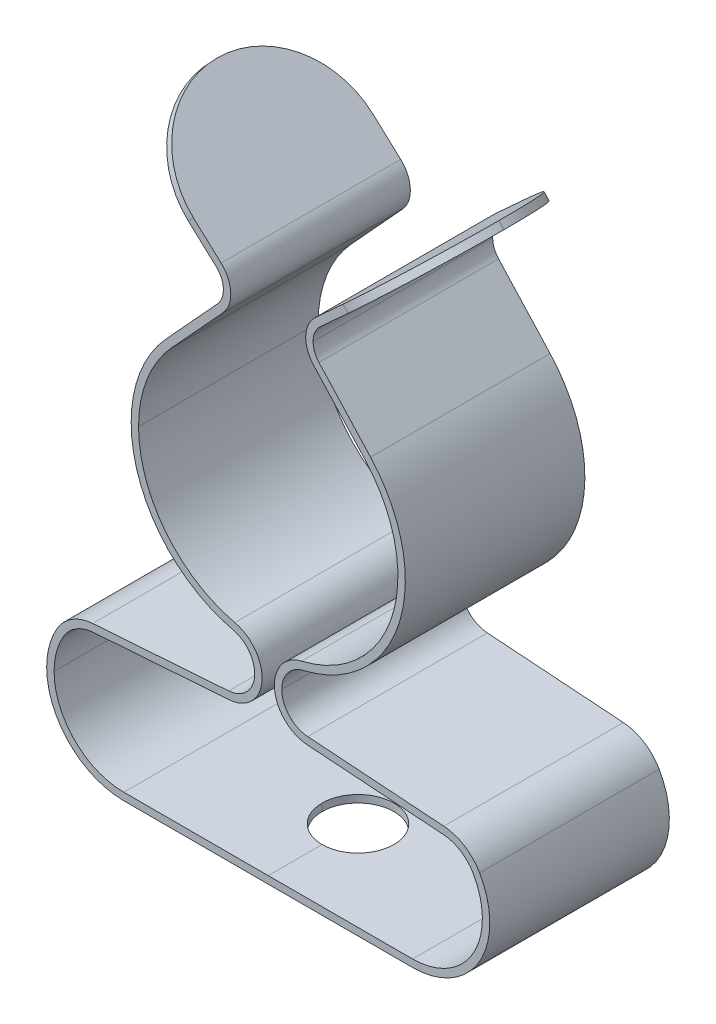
ISO-10303-21;
HEADER;
FILE_DESCRIPTION(('STEP AP214'),'2;1');
FILE_NAME('part.step','',(''),(''),'','','');
FILE_SCHEMA(('AUTOMOTIVE_DESIGN { 1 0 10303 214 1 1 1 1 }'));
ENDSEC;
DATA;
#1=APPLICATION_CONTEXT('core data for automotive mechanical design processes');
#2=APPLICATION_PROTOCOL_DEFINITION('international standard','automotive_design',2000,#1);
#3=PRODUCT_CONTEXT('',#1,'mechanical');
#4=PRODUCT('Part','Part','',(#3));
#5=PRODUCT_RELATED_PRODUCT_CATEGORY('part','',(#4));
#6=PRODUCT_DEFINITION_FORMATION('','',#4);
#7=PRODUCT_DEFINITION_CONTEXT('part definition',#1,'design');
#8=PRODUCT_DEFINITION('design','',#6,#7);
#9=PRODUCT_DEFINITION_SHAPE('','',#8);
#10=(LENGTH_UNIT() NAMED_UNIT(*) SI_UNIT(.MILLI.,.METRE.));
#11=(NAMED_UNIT(*) PLANE_ANGLE_UNIT() SI_UNIT($,.RADIAN.));
#12=(NAMED_UNIT(*) SI_UNIT($,.STERADIAN.) SOLID_ANGLE_UNIT());
#13=UNCERTAINTY_MEASURE_WITH_UNIT(LENGTH_MEASURE(1.E-05),#10,'distance_accuracy_value','');
#14=(GEOMETRIC_REPRESENTATION_CONTEXT(3) GLOBAL_UNCERTAINTY_ASSIGNED_CONTEXT((#13)) GLOBAL_UNIT_ASSIGNED_CONTEXT((#10,
#11,#12)) REPRESENTATION_CONTEXT('',''));
#15=CARTESIAN_POINT('',(0.,0.,0.));
#16=DIRECTION('',(0.,0.,1.));
#17=DIRECTION('',(1.,0.,0.));
#18=AXIS2_PLACEMENT_3D('',#15,#16,#17);
#19=CARTESIAN_POINT('',(0.000101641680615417,0.999999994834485,0.));
#20=DIRECTION('',(-0.000101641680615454,-0.999999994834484,0.));
#21=DIRECTION('',(0.999999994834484,-0.000101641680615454,0.));
#22=AXIS2_PLACEMENT_3D('',#19,#20,#21);
#23=CYLINDRICAL_SURFACE('',#22,1.6);
#24=DIRECTION('',(-0.000101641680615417,-0.999999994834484,0.));
#25=VECTOR('',#24,1.);
#26=CARTESIAN_POINT('',(-1.59989835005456,1.00016262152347,0.));
#27=LINE('',#26,#25);
#28=CARTESIAN_POINT('',(-1.59996644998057,0.330162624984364,0.));
#29=VERTEX_POINT('',#28);
#30=CARTESIAN_POINT('',(-1.59999999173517,0.000162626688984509,0.));
#31=VERTEX_POINT('',#30);
#32=EDGE_CURVE('E662',#29,#31,#27,.T.);
#33=ORIENTED_EDGE('',*,*,#32,.F.);
#34=CARTESIAN_POINT('',(3.35417546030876E-05,0.32999999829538,0.));
#35=DIRECTION('',(-0.00010164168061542,-0.999999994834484,0.));
#36=DIRECTION('',(0.999999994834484,-0.00010164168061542,0.));
#37=AXIS2_PLACEMENT_3D('',#34,#35,#36);
#38=CIRCLE('',#37,1.6);
#39=CARTESIAN_POINT('',(0.,0.33000000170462,1.59999999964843));
#40=VERTEX_POINT('',#39);
#41=EDGE_CURVE('E518',#40,#29,#38,.T.);
#42=ORIENTED_EDGE('',*,*,#41,.F.);
#43=CARTESIAN_POINT('',(1.60003356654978,0.330162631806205,0.));
#44=CARTESIAN_POINT('',(1.60003356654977,0.330162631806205,0.937273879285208));
#45=CARTESIAN_POINT('',(0.937273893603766,0.330095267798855,1.60001964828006));
#46=CARTESIAN_POINT('',(0.,0.33000000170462,1.59999999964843));
#47=(BOUNDED_CURVE() B_SPLINE_CURVE(3,(#43,#44,#45,#46),.UNSPECIFIED.,.F.,
.F.) B_SPLINE_CURVE_WITH_KNOTS((4,4),(3.1415926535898,4.71240994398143),
.UNSPECIFIED.) CURVE() GEOMETRIC_REPRESENTATION_ITEM() RATIONAL_B_SPLINE_CURVE((1.,
0.804732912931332,0.804732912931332,1.)) REPRESENTATION_ITEM(''));
#48=CARTESIAN_POINT('',(1.60003356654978,0.330162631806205,0.));
#49=VERTEX_POINT('',#48);
#50=EDGE_CURVE('E497',#49,#40,#47,.T.);
#51=ORIENTED_EDGE('',*,*,#50,.F.);
#52=DIRECTION('',(-0.000101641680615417,-0.999999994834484,0.));
#53=VECTOR('',#52,1.);
#54=CARTESIAN_POINT('',(1.60010163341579,0.9998373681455,0.));
#55=LINE('',#54,#53);
#56=CARTESIAN_POINT('',(1.60000002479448,0.000162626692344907,0.));
#57=VERTEX_POINT('',#56);
#58=EDGE_CURVE('E625',#49,#57,#55,.T.);
#59=ORIENTED_EDGE('',*,*,#58,.T.);
#60=CARTESIAN_POINT('',(1.60000002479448,0.000162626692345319,0.));
#61=CARTESIAN_POINT('',(1.60000057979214,0.000159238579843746,0.0261799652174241));
#62=CARTESIAN_POINT('',(1.5993574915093,0.000155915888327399,0.0523598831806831));
#63=CARTESIAN_POINT('',(1.5967880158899,0.000149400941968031,0.104656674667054));
#64=CARTESIAN_POINT('',(1.59486162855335,0.00014620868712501,0.130773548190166));
#65=CARTESIAN_POINT('',(1.58972954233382,0.000139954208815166,0.182881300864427));
#66=CARTESIAN_POINT('',(1.58652384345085,0.000136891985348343,0.208872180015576));
#67=CARTESIAN_POINT('',(1.57884103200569,0.000130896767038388,0.260665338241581));
#68=CARTESIAN_POINT('',(1.5743639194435,0.000127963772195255,0.286467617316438));
#69=CARTESIAN_POINT('',(1.56414901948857,0.000122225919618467,0.337821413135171));
#70=CARTESIAN_POINT('',(1.55841123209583,0.000119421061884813,0.363372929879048));
#71=CARTESIAN_POINT('',(1.54568881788,0.000113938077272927,0.414163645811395));
#72=CARTESIAN_POINT('',(1.53870419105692,0.000111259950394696,0.439402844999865));
#73=CARTESIAN_POINT('',(1.52350492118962,0.00010602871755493,0.489508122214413));
#74=CARTESIAN_POINT('',(1.51529027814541,0.000103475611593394,0.514374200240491));
#75=CARTESIAN_POINT('',(1.49765076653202,9.84924090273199E-05,0.563673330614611));
#76=CARTESIAN_POINT('',(1.48822589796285,9.60623124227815E-05,0.588106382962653));
#77=CARTESIAN_POINT('',(1.46818864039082,9.13228207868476E-05,0.636480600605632));
#78=CARTESIAN_POINT('',(1.45757625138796,8.90134257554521E-05,0.66042176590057));
#79=CARTESIAN_POINT('',(1.43518951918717,8.45127386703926E-05,0.70775453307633));
#80=CARTESIAN_POINT('',(1.42341517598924,8.23214466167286E-05,0.731146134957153));
#81=CARTESIAN_POINT('',(1.39873290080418,7.80540823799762E-05,0.777323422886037));
#82=CARTESIAN_POINT('',(1.38582496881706,7.59780101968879E-05,0.800109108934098));
#83=CARTESIAN_POINT('',(1.35890661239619,7.19379250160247E-05,0.845019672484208));
#84=CARTESIAN_POINT('',(1.34489618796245,6.99739120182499E-05,0.867144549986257));
#85=CARTESIAN_POINT('',(1.31580659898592,6.61545145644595E-05,0.910680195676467));
#86=CARTESIAN_POINT('',(1.30072743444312,6.4299130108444E-05,0.932090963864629));
#87=CARTESIAN_POINT('',(1.26953669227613,6.06932973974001E-05,0.974146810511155));
#88=CARTESIAN_POINT('',(1.25342511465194,5.89428491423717E-05,0.994791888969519));
#89=CARTESIAN_POINT('',(1.22020836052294,5.55429436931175E-05,1.03526662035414));
#90=CARTESIAN_POINT('',(1.20310318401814,5.38934864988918E-05,1.0550962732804));
#91=CARTESIAN_POINT('',(1.16794043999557,5.06913747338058E-05,1.09389238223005));
#92=CARTESIAN_POINT('',(1.14988287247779,4.91387201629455E-05,1.11285883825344));
#93=CARTESIAN_POINT('',(1.11285884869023,4.61257920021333E-05,1.14988286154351));
#94=CARTESIAN_POINT('',(1.09389239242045,4.46655184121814E-05,1.1679404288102));
#95=CARTESIAN_POINT('',(1.05509628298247,4.18327080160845E-05,1.20310317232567));
#96=CARTESIAN_POINT('',(1.03526662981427,4.04601712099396E-05,1.22020834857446));
#97=CARTESIAN_POINT('',(0.994791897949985,3.77979788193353E-05,1.2534251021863));
#98=CARTESIAN_POINT('',(0.974146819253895,3.65083232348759E-05,1.26953667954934));
#99=CARTESIAN_POINT('',(0.932090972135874,3.40068380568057E-05,1.30072742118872));
#100=CARTESIAN_POINT('',(0.910680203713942,3.27950084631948E-05,1.31580658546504));
#101=CARTESIAN_POINT('',(0.867144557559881,3.04439325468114E-05,1.3448961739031));
#102=CARTESIAN_POINT('',(0.845019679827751,2.93046862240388E-05,1.35890659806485));
#103=CARTESIAN_POINT('',(0.800109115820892,2.70933592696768E-05,1.38582495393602));
#104=CARTESIAN_POINT('',(0.777323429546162,2.60212786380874E-05,1.39873288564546));
#105=CARTESIAN_POINT('',(0.731146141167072,2.3938703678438E-05,1.42341516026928));
#106=CARTESIAN_POINT('',(0.707754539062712,2.2928209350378E-05,1.43518950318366));
#107=CARTESIAN_POINT('',(0.660421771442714,2.09630792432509E-05,1.45757623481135));
#108=CARTESIAN_POINT('',(0.636480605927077,2.00084434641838E-05,1.46818862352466));
#109=CARTESIAN_POINT('',(0.58810638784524,1.81491681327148E-05,1.48822588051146));
#110=CARTESIAN_POINT('',(0.56367333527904,1.72445285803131E-05,1.49765074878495));
#111=CARTESIAN_POINT('',(0.51437420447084,1.547926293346E-05,1.51529025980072));
#112=CARTESIAN_POINT('',(0.48950812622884,1.46186368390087E-05,1.523504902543));
#113=CARTESIAN_POINT('',(0.439402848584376,1.29353093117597E-05,1.53870417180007));
#114=CARTESIAN_POINT('',(0.414163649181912,1.21126078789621E-05,1.54568879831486));
#115=CARTESIAN_POINT('',(0.36337293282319,1.04989494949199E-05,1.55841121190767));
#116=CARTESIAN_POINT('',(0.337821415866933,9.70799254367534E-06,1.56414899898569));
#117=CARTESIAN_POINT('',(0.286467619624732,8.15156654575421E-06,1.57436389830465));
#118=CARTESIAN_POINT('',(0.26066534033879,7.3860974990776E-06,1.57884101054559));
#119=CARTESIAN_POINT('',(0.208872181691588,5.87432903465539E-06,1.5865238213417));
#120=CARTESIAN_POINT('',(0.182881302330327,5.1280296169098E-06,1.58972951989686));
#121=CARTESIAN_POINT('',(0.130773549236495,3.64823706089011E-06,1.59486160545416));
#122=CARTESIAN_POINT('',(0.104656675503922,2.914743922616E-06,1.59678799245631));
#123=CARTESIAN_POINT('',(0.0523598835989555,1.45416558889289E-06,1.59935746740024));
#124=CARTESIAN_POINT('',(0.0261799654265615,7.27080393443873E-07,1.60000055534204));
#125=CARTESIAN_POINT('',(0.,0.,1.6));
#126=B_SPLINE_CURVE_WITH_KNOTS('',3,(#60,#61,#62,#63,#64,#65,#66,#67,#68,#69,#70,#71,#72,#73,
#74,#75,#76,#77,#78,#79,#80,#81,#82,#83,#84,#85,#86,#87,#88,#89,#90,#91,#92,#93,#94,#95,#96,#97,
#98,#99,#100,#101,#102,#103,#104,#105,#106,#107,#108,#109,#110,#111,#112,#113,#114,#115,#116,
#117,#118,#119,#120,#121,#122,#123,#124,#125),.UNSPECIFIED.,.F.,.F.,(4,2,2,2,2,2,2,2,2,2,2,2,2,
2,2,2,2,2,2,2,2,2,2,2,2,2,2,2,2,2,2,2,4),(0.,0.0785319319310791,0.157063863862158,
0.235595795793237,0.314127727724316,0.392659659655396,0.471191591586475,0.549723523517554,
0.628255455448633,0.706787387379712,0.785319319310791,0.86385125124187,0.942383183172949,
1.02091511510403,1.09944704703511,1.17797897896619,1.25651091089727,1.33504284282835,
1.41357477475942,1.4921067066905,1.57063863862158,1.64917057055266,1.72770250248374,
1.80623443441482,1.8847663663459,1.96329829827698,2.04183023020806,2.12036216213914,
2.19889409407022,2.27742602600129,2.35595795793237,2.43448988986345,2.51302182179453),.UNSPECIFIED.);
#127=CARTESIAN_POINT('',(0.,0.,1.6));
#128=VERTEX_POINT('',#127);
#129=EDGE_CURVE('E392',#57,#128,#126,.T.);
#130=ORIENTED_EDGE('',*,*,#129,.T.);
#131=CARTESIAN_POINT('',(0.,0.,0.));
#132=DIRECTION('',(-0.000101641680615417,-0.999999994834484,0.));
#133=DIRECTION('',(0.999999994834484,-0.000101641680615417,0.));
#134=AXIS2_PLACEMENT_3D('',#131,#132,#133);
#135=CIRCLE('',#134,1.6);
#136=EDGE_CURVE('E372',#128,#31,#135,.T.);
#137=ORIENTED_EDGE('',*,*,#136,.T.);
#138=EDGE_LOOP('',(#33,#42,#51,#59,#130,#137));
#139=FACE_BOUND('',#138,.T.);
#140=ADVANCED_FACE('F15',(#139),#23,.F.);
#141=CARTESIAN_POINT('',(-3.55801348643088,23.8046678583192,0.00999999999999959));
#142=DIRECTION('',(0.67552184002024,0.737339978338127,0.));
#143=DIRECTION('',(-0.737339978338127,0.67552184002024,0.));
#144=AXIS2_PLACEMENT_3D('',#141,#142,#143);
#145=CYLINDRICAL_SURFACE('',#144,3.99);
#146=CARTESIAN_POINT('',(-3.55801348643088,23.8046678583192,0.00999999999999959));
#147=DIRECTION('',(-0.675521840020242,-0.737339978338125,0.));
#148=DIRECTION('',(0.737339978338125,-0.675521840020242,0.));
#149=AXIS2_PLACEMENT_3D('',#146,#147,#148);
#150=CIRCLE('',#149,3.99);
#151=CARTESIAN_POINT('',(-3.55801348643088,23.8046678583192,4.));
#152=VERTEX_POINT('',#151);
#153=CARTESIAN_POINT('',(-6.5,26.5,0.00999999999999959));
#154=VERTEX_POINT('',#153);
#155=EDGE_CURVE('E280',#152,#154,#150,.T.);
#156=ORIENTED_EDGE('',*,*,#155,.F.);
#157=DIRECTION('',(-0.675521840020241,-0.737339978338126,0.));
#158=VECTOR('',#157,1.);
#159=CARTESIAN_POINT('',(-4.23353532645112,23.0673278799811,4.));
#160=LINE('',#159,#158);
#161=CARTESIAN_POINT('',(-3.3350912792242,24.0479900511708,4.));
#162=VERTEX_POINT('',#161);
#163=EDGE_CURVE('E595',#162,#152,#160,.T.);
#164=ORIENTED_EDGE('',*,*,#163,.F.);
#165=CARTESIAN_POINT('',(-3.3350912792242,24.0479900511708,0.00999999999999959));
#166=DIRECTION('',(0.675521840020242,0.737339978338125,0.));
#167=DIRECTION('',(0.737339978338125,-0.675521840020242,0.));
#168=AXIS2_PLACEMENT_3D('',#165,#166,#167);
#169=CIRCLE('',#168,3.99);
#170=CARTESIAN_POINT('',(-6.27707779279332,26.7433221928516,0.00999999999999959));
#171=VERTEX_POINT('',#170);
#172=EDGE_CURVE('E871',#171,#162,#169,.T.);
#173=ORIENTED_EDGE('',*,*,#172,.F.);
#174=DIRECTION('',(0.675521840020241,0.737339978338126,0.));
#175=VECTOR('',#174,1.);
#176=CARTESIAN_POINT('',(-6.5,26.5,0.00999999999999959));
#177=LINE('',#176,#175);
#178=EDGE_CURVE('E267',#154,#171,#177,.T.);
#179=ORIENTED_EDGE('',*,*,#178,.F.);
#180=EDGE_LOOP('',(#156,#164,#173,#179));
#181=FACE_BOUND('',#180,.T.);
#182=ADVANCED_FACE('F916',(#181),#145,.T.);
#183=CARTESIAN_POINT('',(-4.23353532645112,23.0673278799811,-0.00999999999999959));
#184=DIRECTION('',(-0.67552184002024,-0.737339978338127,0.));
#185=DIRECTION('',(0.737339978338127,-0.67552184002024,0.));
#186=AXIS2_PLACEMENT_3D('',#183,#184,#185);
#187=CYLINDRICAL_SURFACE('',#186,3.99);
#188=CARTESIAN_POINT('',(-3.55801348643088,23.8046678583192,-0.00999999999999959));
#189=DIRECTION('',(-0.675521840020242,-0.737339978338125,0.));
#190=DIRECTION('',(0.737339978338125,-0.675521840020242,0.));
#191=AXIS2_PLACEMENT_3D('',#188,#189,#190);
#192=CIRCLE('',#191,3.99);
#193=CARTESIAN_POINT('',(-6.5,26.5,-0.00999999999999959));
#194=VERTEX_POINT('',#193);
#195=CARTESIAN_POINT('',(-3.55801348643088,23.8046678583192,-4.));
#196=VERTEX_POINT('',#195);
#197=EDGE_CURVE('E269',#194,#196,#192,.T.);
#198=ORIENTED_EDGE('',*,*,#197,.F.);
#199=DIRECTION('',(-0.675521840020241,-0.737339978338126,0.));
#200=VECTOR('',#199,1.);
#201=CARTESIAN_POINT('',(-6.5,26.5,-0.00999999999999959));
#202=LINE('',#201,#200);
#203=CARTESIAN_POINT('',(-6.27707779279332,26.7433221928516,-0.00999999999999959));
#204=VERTEX_POINT('',#203);
#205=EDGE_CURVE('E887',#204,#194,#202,.T.);
#206=ORIENTED_EDGE('',*,*,#205,.F.);
#207=CARTESIAN_POINT('',(-3.3350912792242,24.0479900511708,-0.00999999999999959));
#208=DIRECTION('',(0.675521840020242,0.737339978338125,0.));
#209=DIRECTION('',(0.737339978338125,-0.675521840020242,0.));
#210=AXIS2_PLACEMENT_3D('',#207,#208,#209);
#211=CIRCLE('',#210,3.99);
#212=CARTESIAN_POINT('',(-3.3350912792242,24.0479900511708,-4.));
#213=VERTEX_POINT('',#212);
#214=EDGE_CURVE('E857',#213,#204,#211,.T.);
#215=ORIENTED_EDGE('',*,*,#214,.F.);
#216=DIRECTION('',(0.675521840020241,0.737339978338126,0.));
#217=VECTOR('',#216,1.);
#218=CARTESIAN_POINT('',(-3.3350912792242,24.0479900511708,-4.));
#219=LINE('',#218,#217);
#220=EDGE_CURVE('E9',#196,#213,#219,.T.);
#221=ORIENTED_EDGE('',*,*,#220,.F.);
#222=EDGE_LOOP('',(#198,#206,#215,#221));
#223=FACE_BOUND('',#222,.T.);
#224=ADVANCED_FACE('F929',(#223),#187,.T.);
#225=CARTESIAN_POINT('',(3.3350912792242,24.0479900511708,0.00999999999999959));
#226=DIRECTION('',(0.675521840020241,-0.737339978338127,0.));
#227=DIRECTION('',(0.737339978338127,0.675521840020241,0.));
#228=AXIS2_PLACEMENT_3D('',#225,#226,#227);
#229=CYLINDRICAL_SURFACE('',#228,3.99);
#230=CARTESIAN_POINT('',(3.3350912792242,24.0479900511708,0.00999999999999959));
#231=DIRECTION('',(-0.675521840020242,0.737339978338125,0.));
#232=DIRECTION('',(0.737339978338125,0.675521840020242,0.));
#233=AXIS2_PLACEMENT_3D('',#230,#231,#232);
#234=CIRCLE('',#233,3.99);
#235=CARTESIAN_POINT('',(3.3350912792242,24.0479900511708,4.));
#236=VERTEX_POINT('',#235);
#237=CARTESIAN_POINT('',(6.27707779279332,26.7433221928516,0.00999999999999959));
#238=VERTEX_POINT('',#237);
#239=EDGE_CURVE('E242',#236,#238,#234,.T.);
#240=ORIENTED_EDGE('',*,*,#239,.F.);
#241=DIRECTION('',(-0.675521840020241,0.737339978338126,0.));
#242=VECTOR('',#241,1.);
#243=CARTESIAN_POINT('',(1.49676564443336,26.05454395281,4.));
#244=LINE('',#243,#242);
#245=CARTESIAN_POINT('',(3.55801348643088,23.8046678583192,4.));
#246=VERTEX_POINT('',#245);
#247=EDGE_CURVE('E248',#246,#236,#244,.T.);
#248=ORIENTED_EDGE('',*,*,#247,.F.);
#249=CARTESIAN_POINT('',(3.55801348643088,23.8046678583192,0.00999999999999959));
#250=DIRECTION('',(0.675521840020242,-0.737339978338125,0.));
#251=DIRECTION('',(0.737339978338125,0.675521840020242,0.));
#252=AXIS2_PLACEMENT_3D('',#249,#250,#251);
#253=CIRCLE('',#252,3.99);
#254=CARTESIAN_POINT('',(6.5,26.5,0.00999999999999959));
#255=VERTEX_POINT('',#254);
#256=EDGE_CURVE('E453',#255,#246,#253,.T.);
#257=ORIENTED_EDGE('',*,*,#256,.F.);
#258=DIRECTION('',(0.675521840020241,-0.737339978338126,0.));
#259=VECTOR('',#258,1.);
#260=CARTESIAN_POINT('',(6.27707779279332,26.7433221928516,0.00999999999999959));
#261=LINE('',#260,#259);
#262=EDGE_CURVE('E456',#238,#255,#261,.T.);
#263=ORIENTED_EDGE('',*,*,#262,.F.);
#264=EDGE_LOOP('',(#240,#248,#257,#263));
#265=FACE_BOUND('',#264,.T.);
#266=ADVANCED_FACE('F1303',(#265),#229,.T.);
#267=CARTESIAN_POINT('',(1.49676564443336,26.05454395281,-0.00999999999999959));
#268=DIRECTION('',(-0.67552184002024,0.737339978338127,0.));
#269=DIRECTION('',(-0.737339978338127,-0.67552184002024,0.));
#270=AXIS2_PLACEMENT_3D('',#267,#268,#269);
#271=CYLINDRICAL_SURFACE('',#270,3.99);
#272=CARTESIAN_POINT('',(3.3350912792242,24.0479900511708,-0.00999999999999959));
#273=DIRECTION('',(-0.675521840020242,0.737339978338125,0.));
#274=DIRECTION('',(0.737339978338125,0.675521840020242,0.));
#275=AXIS2_PLACEMENT_3D('',#272,#273,#274);
#276=CIRCLE('',#275,3.99);
#277=CARTESIAN_POINT('',(6.27707779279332,26.7433221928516,-0.00999999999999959));
#278=VERTEX_POINT('',#277);
#279=CARTESIAN_POINT('',(3.3350912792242,24.0479900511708,-4.));
#280=VERTEX_POINT('',#279);
#281=EDGE_CURVE('E263',#278,#280,#276,.T.);
#282=ORIENTED_EDGE('',*,*,#281,.F.);
#283=DIRECTION('',(-0.675521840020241,0.737339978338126,0.));
#284=VECTOR('',#283,1.);
#285=CARTESIAN_POINT('',(6.27707779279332,26.7433221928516,-0.00999999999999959));
#286=LINE('',#285,#284);
#287=CARTESIAN_POINT('',(6.5,26.5,-0.00999999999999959));
#288=VERTEX_POINT('',#287);
#289=EDGE_CURVE('E374',#288,#278,#286,.T.);
#290=ORIENTED_EDGE('',*,*,#289,.F.);
#291=CARTESIAN_POINT('',(3.55801348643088,23.8046678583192,-0.00999999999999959));
#292=DIRECTION('',(0.675521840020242,-0.737339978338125,0.));
#293=DIRECTION('',(0.737339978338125,0.675521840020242,0.));
#294=AXIS2_PLACEMENT_3D('',#291,#292,#293);
#295=CIRCLE('',#294,3.99);
#296=CARTESIAN_POINT('',(3.55801348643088,23.8046678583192,-4.));
#297=VERTEX_POINT('',#296);
#298=EDGE_CURVE('E444',#297,#288,#295,.T.);
#299=ORIENTED_EDGE('',*,*,#298,.F.);
#300=DIRECTION('',(0.675521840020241,-0.737339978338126,0.));
#301=VECTOR('',#300,1.);
#302=CARTESIAN_POINT('',(3.55801348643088,23.8046678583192,-4.));
#303=LINE('',#302,#301);
#304=EDGE_CURVE('E26',#280,#297,#303,.T.);
#305=ORIENTED_EDGE('',*,*,#304,.F.);
#306=EDGE_LOOP('',(#282,#290,#299,#305));
#307=FACE_BOUND('',#306,.T.);
#308=ADVANCED_FACE('F1300',(#307),#271,.T.);
#309=CARTESIAN_POINT('',(-2.99867545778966,21.9359979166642,-4.));
#310=DIRECTION('',(0.,0.,1.));
#311=DIRECTION('',(1.,0.,0.));
#312=AXIS2_PLACEMENT_3D('',#309,#310,#311);
#313=PLANE('',#312);
#314=DIRECTION('',(-0.737339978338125,-0.675521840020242,0.));
#315=VECTOR('',#314,1.);
#316=CARTESIAN_POINT('',(6.27707779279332,26.7433221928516,-4.));
#317=LINE('',#316,#315);
#318=CARTESIAN_POINT('',(2.10023141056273,22.9166600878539,-4.));
#319=VERTEX_POINT('',#318);
#320=EDGE_CURVE('E256',#280,#319,#317,.T.);
#321=ORIENTED_EDGE('',*,*,#320,.F.);
#322=ORIENTED_EDGE('',*,*,#304,.T.);
#323=DIRECTION('',(-0.737339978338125,-0.675521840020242,0.));
#324=VECTOR('',#323,1.);
#325=CARTESIAN_POINT('',(6.5,26.5,-4.));
#326=LINE('',#325,#324);
#327=CARTESIAN_POINT('',(2.32315361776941,22.6733378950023,-4.));
#328=VERTEX_POINT('',#327);
#329=EDGE_CURVE('E449',#297,#328,#326,.T.);
#330=ORIENTED_EDGE('',*,*,#329,.T.);
#331=CARTESIAN_POINT('',(2.99867545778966,21.9359979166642,-4.));
#332=DIRECTION('',(0.,0.,1.));
#333=DIRECTION('',(1.,0.,0.));
#334=AXIS2_PLACEMENT_3D('',#331,#332,#333);
#335=CIRCLE('',#334,1.);
#336=CARTESIAN_POINT('',(1.99867545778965,21.9359979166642,-4.));
#337=VERTEX_POINT('',#336);
#338=EDGE_CURVE('E751',#328,#337,#335,.T.);
#339=ORIENTED_EDGE('',*,*,#338,.T.);
#340=CARTESIAN_POINT('',(2.99867545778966,21.9359979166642,-4.));
#341=DIRECTION('',(0.,0.,1.));
#342=DIRECTION('',(1.,0.,0.));
#343=AXIS2_PLACEMENT_3D('',#340,#341,#342);
#344=CIRCLE('',#343,1.);
#345=CARTESIAN_POINT('',(2.26133547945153,21.2604760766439,-4.));
#346=VERTEX_POINT('',#345);
#347=EDGE_CURVE('E397',#337,#346,#344,.T.);
#348=ORIENTED_EDGE('',*,*,#347,.T.);
#349=DIRECTION('',(0.675521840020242,-0.737339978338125,0.));
#350=VECTOR('',#349,1.);
#351=CARTESIAN_POINT('',(2.26133547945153,21.2604760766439,-4.));
#352=LINE('',#351,#350);
#353=CARTESIAN_POINT('',(4.55819344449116,18.753428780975,-4.));
#354=VERTEX_POINT('',#353);
#355=EDGE_CURVE('E433',#346,#354,#352,.T.);
#356=ORIENTED_EDGE('',*,*,#355,.T.);
#357=CARTESIAN_POINT('',(0.209659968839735,14.7694737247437,-4.));
#358=DIRECTION('',(0.,0.,-1.));
#359=DIRECTION('',(-1.,0.,0.));
#360=AXIS2_PLACEMENT_3D('',#357,#358,#359);
#361=CIRCLE('',#360,5.89759622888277);
#362=CARTESIAN_POINT('',(1.56250570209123,9.02913839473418,-4.));
#363=VERTEX_POINT('',#362);
#364=EDGE_CURVE('E335',#354,#363,#361,.T.);
#365=ORIENTED_EDGE('',*,*,#364,.T.);
#366=CARTESIAN_POINT('',(1.84811082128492,7.81727135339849,-4.));
#367=DIRECTION('',(0.,0.,1.));
#368=DIRECTION('',(1.,0.,0.));
#369=AXIS2_PLACEMENT_3D('',#366,#367,#368);
#370=CIRCLE('',#369,1.24506707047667);
#371=CARTESIAN_POINT('',(0.603043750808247,7.81727135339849,-4.));
#372=VERTEX_POINT('',#371);
#373=EDGE_CURVE('E814',#363,#372,#370,.T.);
#374=ORIENTED_EDGE('',*,*,#373,.T.);
#375=CARTESIAN_POINT('',(1.84811082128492,7.81727135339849,-4.));
#376=DIRECTION('',(0.,0.,1.));
#377=DIRECTION('',(1.,0.,0.));
#378=AXIS2_PLACEMENT_3D('',#375,#376,#377);
#379=CIRCLE('',#378,1.24506707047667);
#380=CARTESIAN_POINT('',(1.76065537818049,6.5752795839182,-4.));
#381=VERTEX_POINT('',#380);
#382=EDGE_CURVE('E340',#372,#381,#379,.T.);
#383=ORIENTED_EDGE('',*,*,#382,.T.);
#384=DIRECTION('',(0.997530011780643,-0.0702415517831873,0.));
#385=VECTOR('',#384,1.);
#386=CARTESIAN_POINT('',(1.76065537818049,6.5752795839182,-4.));
#387=LINE('',#386,#385);
#388=CARTESIAN_POINT('',(7.82164636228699,6.1484920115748,-4.));
#389=VERTEX_POINT('',#388);
#390=EDGE_CURVE('E290',#381,#389,#387,.T.);
#391=ORIENTED_EDGE('',*,*,#390,.T.);
#392=CARTESIAN_POINT('',(7.68116325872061,4.15343198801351,-4.));
#393=DIRECTION('',(0.,0.,-1.));
#394=DIRECTION('',(1.,0.,0.));
#395=AXIS2_PLACEMENT_3D('',#392,#393,#394);
#396=CIRCLE('',#395,2.);
#397=CARTESIAN_POINT('',(9.41754901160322,5.14588577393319,-4.));
#398=VERTEX_POINT('',#397);
#399=EDGE_CURVE('E407',#389,#398,#396,.T.);
#400=ORIENTED_EDGE('',*,*,#399,.T.);
#401=CARTESIAN_POINT('',(6.4320033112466,3.4394584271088,-4.));
#402=DIRECTION('',(0.,0.,-1.));
#403=DIRECTION('',(-1.,0.,0.));
#404=AXIS2_PLACEMENT_3D('',#401,#402,#403);
#405=CIRCLE('',#404,3.43880464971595);
#406=CARTESIAN_POINT('',(6.43235283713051,0.000653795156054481,-4.));
#407=VERTEX_POINT('',#406);
#408=EDGE_CURVE('E399',#398,#407,#405,.T.);
#409=ORIENTED_EDGE('',*,*,#408,.T.);
#410=DIRECTION('',(-0.999999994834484,-0.000101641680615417,0.));
#411=VECTOR('',#410,1.);
#412=CARTESIAN_POINT('',(6.43235283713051,0.000653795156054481,-4.));
#413=LINE('',#412,#411);
#414=CARTESIAN_POINT('',(0.,0.,-4.));
#415=VERTEX_POINT('',#414);
#416=EDGE_CURVE('E380',#407,#415,#413,.T.);
#417=ORIENTED_EDGE('',*,*,#416,.T.);
#418=DIRECTION('',(-0.999999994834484,0.000101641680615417,0.));
#419=VECTOR('',#418,1.);
#420=CARTESIAN_POINT('',(-6.43235283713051,0.000653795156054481,-4.));
#421=LINE('',#420,#419);
#422=CARTESIAN_POINT('',(-6.43235283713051,0.000653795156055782,-4.));
#423=VERTEX_POINT('',#422);
#424=EDGE_CURVE('E656',#415,#423,#421,.T.);
#425=ORIENTED_EDGE('',*,*,#424,.T.);
#426=CARTESIAN_POINT('',(-6.4320033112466,3.4394584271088,-4.));
#427=DIRECTION('',(0.,0.,-1.));
#428=DIRECTION('',(1.,0.,0.));
#429=AXIS2_PLACEMENT_3D('',#426,#427,#428);
#430=CIRCLE('',#429,3.43880464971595);
#431=CARTESIAN_POINT('',(-9.87080796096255,3.4394584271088,-4.));
#432=VERTEX_POINT('',#431);
#433=EDGE_CURVE('E830',#423,#432,#430,.T.);
#434=ORIENTED_EDGE('',*,*,#433,.T.);
#435=CARTESIAN_POINT('',(-6.4320033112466,3.4394584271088,-4.));
#436=DIRECTION('',(0.,0.,-1.));
#437=DIRECTION('',(1.,0.,0.));
#438=AXIS2_PLACEMENT_3D('',#435,#436,#437);
#439=CIRCLE('',#438,3.43880464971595);
#440=CARTESIAN_POINT('',(-9.41754901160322,5.14588577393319,-4.));
#441=VERTEX_POINT('',#440);
#442=EDGE_CURVE('E368',#432,#441,#439,.T.);
#443=ORIENTED_EDGE('',*,*,#442,.T.);
#444=CARTESIAN_POINT('',(-7.68116325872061,4.15343198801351,-4.));
#445=DIRECTION('',(0.,0.,-1.));
#446=DIRECTION('',(-1.,0.,0.));
#447=AXIS2_PLACEMENT_3D('',#444,#445,#446);
#448=CIRCLE('',#447,2.);
#449=CARTESIAN_POINT('',(-7.82164636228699,6.1484920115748,-4.));
#450=VERTEX_POINT('',#449);
#451=EDGE_CURVE('E362',#441,#450,#448,.T.);
#452=ORIENTED_EDGE('',*,*,#451,.T.);
#453=DIRECTION('',(0.997530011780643,0.0702415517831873,0.));
#454=VECTOR('',#453,1.);
#455=CARTESIAN_POINT('',(-1.76065537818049,6.5752795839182,-4.));
#456=LINE('',#455,#454);
#457=CARTESIAN_POINT('',(-1.76065537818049,6.5752795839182,-4.));
#458=VERTEX_POINT('',#457);
#459=EDGE_CURVE('E341',#450,#458,#456,.T.);
#460=ORIENTED_EDGE('',*,*,#459,.T.);
#461=CARTESIAN_POINT('',(-1.84811082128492,7.81727135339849,-4.));
#462=DIRECTION('',(0.,0.,1.));
#463=DIRECTION('',(-1.,0.,0.));
#464=AXIS2_PLACEMENT_3D('',#461,#462,#463);
#465=CIRCLE('',#464,1.24506707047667);
#466=CARTESIAN_POINT('',(-1.56250570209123,9.02913839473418,-4.));
#467=VERTEX_POINT('',#466);
#468=EDGE_CURVE('E330',#458,#467,#465,.T.);
#469=ORIENTED_EDGE('',*,*,#468,.T.);
#470=CARTESIAN_POINT('',(-0.209659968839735,14.7694737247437,-4.));
#471=DIRECTION('',(0.,0.,-1.));
#472=DIRECTION('',(1.,0.,0.));
#473=AXIS2_PLACEMENT_3D('',#470,#471,#472);
#474=CIRCLE('',#473,5.89759622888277);
#475=CARTESIAN_POINT('',(-6.1072561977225,14.7694737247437,-4.));
#476=VERTEX_POINT('',#475);
#477=EDGE_CURVE('E742',#467,#476,#474,.T.);
#478=ORIENTED_EDGE('',*,*,#477,.T.);
#479=CARTESIAN_POINT('',(-0.209659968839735,14.7694737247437,-4.));
#480=DIRECTION('',(0.,0.,-1.));
#481=DIRECTION('',(1.,0.,0.));
#482=AXIS2_PLACEMENT_3D('',#479,#480,#481);
#483=CIRCLE('',#482,5.89759622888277);
#484=CARTESIAN_POINT('',(-4.55819344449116,18.753428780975,-4.));
#485=VERTEX_POINT('',#484);
#486=EDGE_CURVE('E327',#476,#485,#483,.T.);
#487=ORIENTED_EDGE('',*,*,#486,.T.);
#488=DIRECTION('',(0.675521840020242,0.737339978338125,0.));
#489=VECTOR('',#488,1.);
#490=CARTESIAN_POINT('',(-2.26133547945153,21.2604760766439,-4.));
#491=LINE('',#490,#489);
#492=CARTESIAN_POINT('',(-2.26133547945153,21.2604760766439,-4.));
#493=VERTEX_POINT('',#492);
#494=EDGE_CURVE('E302',#485,#493,#491,.T.);
#495=ORIENTED_EDGE('',*,*,#494,.T.);
#496=CARTESIAN_POINT('',(-2.99867545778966,21.9359979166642,-4.));
#497=DIRECTION('',(0.,0.,1.));
#498=DIRECTION('',(-1.,0.,0.));
#499=AXIS2_PLACEMENT_3D('',#496,#497,#498);
#500=CIRCLE('',#499,1.);
#501=CARTESIAN_POINT('',(-2.32315361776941,22.6733378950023,-4.));
#502=VERTEX_POINT('',#501);
#503=EDGE_CURVE('E284',#493,#502,#500,.T.);
#504=ORIENTED_EDGE('',*,*,#503,.T.);
#505=DIRECTION('',(-0.737339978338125,0.675521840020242,0.));
#506=VECTOR('',#505,1.);
#507=CARTESIAN_POINT('',(-6.5,26.5,-4.));
#508=LINE('',#507,#506);
#509=EDGE_CURVE('E272',#502,#196,#508,.T.);
#510=ORIENTED_EDGE('',*,*,#509,.T.);
#511=ORIENTED_EDGE('',*,*,#220,.T.);
#512=DIRECTION('',(-0.737339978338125,0.675521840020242,0.));
#513=VECTOR('',#512,1.);
#514=CARTESIAN_POINT('',(-6.27707779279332,26.7433221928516,-4.));
#515=LINE('',#514,#513);
#516=CARTESIAN_POINT('',(-2.10023141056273,22.9166600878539,-4.));
#517=VERTEX_POINT('',#516);
#518=EDGE_CURVE('E741',#517,#213,#515,.T.);
#519=ORIENTED_EDGE('',*,*,#518,.F.);
#520=CARTESIAN_POINT('',(-2.99867545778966,21.9359979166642,-4.));
#521=DIRECTION('',(0.,0.,1.));
#522=DIRECTION('',(1.,0.,0.));
#523=AXIS2_PLACEMENT_3D('',#520,#521,#522);
#524=CIRCLE('',#523,1.33);
#525=CARTESIAN_POINT('',(-2.01801328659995,21.0375538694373,-4.));
#526=VERTEX_POINT('',#525);
#527=EDGE_CURVE('E590',#526,#517,#524,.T.);
#528=ORIENTED_EDGE('',*,*,#527,.F.);
#529=DIRECTION('',(0.675521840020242,0.737339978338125,0.));
#530=VECTOR('',#529,1.);
#531=CARTESIAN_POINT('',(-2.01801328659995,21.0375538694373,-4.));
#532=LINE('',#531,#530);
#533=CARTESIAN_POINT('',(-4.31487125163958,18.5305065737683,-4.));
#534=VERTEX_POINT('',#533);
#535=EDGE_CURVE('E580',#534,#526,#532,.T.);
#536=ORIENTED_EDGE('',*,*,#535,.F.);
#537=CARTESIAN_POINT('',(-0.209659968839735,14.7694737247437,-4.));
#538=DIRECTION('',(0.,0.,-1.));
#539=DIRECTION('',(1.,0.,0.));
#540=AXIS2_PLACEMENT_3D('',#537,#538,#539);
#541=CIRCLE('',#540,5.56759622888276);
#542=CARTESIAN_POINT('',(-5.7772561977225,14.7694737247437,-4.));
#543=VERTEX_POINT('',#542);
#544=EDGE_CURVE('E715',#543,#534,#541,.T.);
#545=ORIENTED_EDGE('',*,*,#544,.F.);
#546=CARTESIAN_POINT('',(-0.209659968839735,14.7694737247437,-4.));
#547=DIRECTION('',(0.,0.,-1.));
#548=DIRECTION('',(1.,0.,0.));
#549=AXIS2_PLACEMENT_3D('',#546,#547,#548);
#550=CIRCLE('',#549,5.56759622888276);
#551=CARTESIAN_POINT('',(-1.48680721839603,9.35033886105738,-4.));
#552=VERTEX_POINT('',#551);
#553=EDGE_CURVE('E576',#552,#543,#550,.T.);
#554=ORIENTED_EDGE('',*,*,#553,.F.);
#555=CARTESIAN_POINT('',(-1.84811082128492,7.81727135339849,-4.));
#556=DIRECTION('',(0.,0.,1.));
#557=DIRECTION('',(1.,0.,0.));
#558=AXIS2_PLACEMENT_3D('',#555,#556,#557);
#559=CIRCLE('',#558,1.57506707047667);
#560=CARTESIAN_POINT('',(-1.73747566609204,6.24609468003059,-4.));
#561=VERTEX_POINT('',#560);
#562=EDGE_CURVE('E560',#561,#552,#559,.T.);
#563=ORIENTED_EDGE('',*,*,#562,.F.);
#564=DIRECTION('',(0.997530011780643,0.0702415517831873,0.));
#565=VECTOR('',#564,1.);
#566=CARTESIAN_POINT('',(-1.73747566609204,6.24609468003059,-4.));
#567=LINE('',#566,#565);
#568=CARTESIAN_POINT('',(-7.79846665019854,5.81930710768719,-4.));
#569=VERTEX_POINT('',#568);
#570=EDGE_CURVE('E102',#569,#561,#567,.T.);
#571=ORIENTED_EDGE('',*,*,#570,.F.);
#572=CARTESIAN_POINT('',(-7.68116325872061,4.15343198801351,-4.));
#573=DIRECTION('',(0.,0.,-1.));
#574=DIRECTION('',(1.,0.,0.));
#575=AXIS2_PLACEMENT_3D('',#572,#573,#574);
#576=CIRCLE('',#575,1.67);
#577=CARTESIAN_POINT('',(-9.13104536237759,4.98213089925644,-4.));
#578=VERTEX_POINT('',#577);
#579=EDGE_CURVE('E542',#578,#569,#576,.T.);
#580=ORIENTED_EDGE('',*,*,#579,.F.);
#581=CARTESIAN_POINT('',(-6.4320033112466,3.4394584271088,-4.));
#582=DIRECTION('',(0.,0.,-1.));
#583=DIRECTION('',(1.,0.,0.));
#584=AXIS2_PLACEMENT_3D('',#581,#582,#583);
#585=CIRCLE('',#584,3.10880464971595);
#586=CARTESIAN_POINT('',(-9.54080796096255,3.4394584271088,-4.));
#587=VERTEX_POINT('',#586);
#588=EDGE_CURVE('E693',#587,#578,#585,.T.);
#589=ORIENTED_EDGE('',*,*,#588,.F.);
#590=CARTESIAN_POINT('',(-6.4320033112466,3.4394584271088,-4.));
#591=DIRECTION('',(0.,0.,-1.));
#592=DIRECTION('',(1.,0.,0.));
#593=AXIS2_PLACEMENT_3D('',#590,#591,#592);
#594=CIRCLE('',#593,3.10880464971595);
#595=CARTESIAN_POINT('',(-6.43231929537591,0.330653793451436,-4.));
#596=VERTEX_POINT('',#595);
#597=EDGE_CURVE('E538',#596,#587,#594,.T.);
#598=ORIENTED_EDGE('',*,*,#597,.F.);
#599=DIRECTION('',(-0.999999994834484,0.000101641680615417,0.));
#600=VECTOR('',#599,1.);
#601=CARTESIAN_POINT('',(-6.43231929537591,0.330653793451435,-4.));
#602=LINE('',#601,#600);
#603=CARTESIAN_POINT('',(0.,0.33000000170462,-4.));
#604=VERTEX_POINT('',#603);
#605=EDGE_CURVE('E522',#604,#596,#602,.T.);
#606=ORIENTED_EDGE('',*,*,#605,.F.);
#607=DIRECTION('',(-0.999999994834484,-0.000101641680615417,0.));
#608=VECTOR('',#607,1.);
#609=CARTESIAN_POINT('',(6.43231929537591,0.330653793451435,-4.));
#610=LINE('',#609,#608);
#611=CARTESIAN_POINT('',(6.43231929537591,0.330653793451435,-4.));
#612=VERTEX_POINT('',#611);
#613=EDGE_CURVE('E514',#612,#604,#610,.T.);
#614=ORIENTED_EDGE('',*,*,#613,.F.);
#615=CARTESIAN_POINT('',(6.4320033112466,3.4394584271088,-4.));
#616=DIRECTION('',(0.,0.,-1.));
#617=DIRECTION('',(1.,0.,0.));
#618=AXIS2_PLACEMENT_3D('',#615,#616,#617);
#619=CIRCLE('',#618,3.10880464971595);
#620=CARTESIAN_POINT('',(9.13104536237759,4.98213089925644,-4.));
#621=VERTEX_POINT('',#620);
#622=EDGE_CURVE('E487',#621,#612,#619,.T.);
#623=ORIENTED_EDGE('',*,*,#622,.F.);
#624=CARTESIAN_POINT('',(7.68116325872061,4.15343198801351,-4.));
#625=DIRECTION('',(0.,0.,-1.));
#626=DIRECTION('',(1.,0.,0.));
#627=AXIS2_PLACEMENT_3D('',#624,#625,#626);
#628=CIRCLE('',#627,1.67);
#629=CARTESIAN_POINT('',(7.79846665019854,5.81930710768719,-4.));
#630=VERTEX_POINT('',#629);
#631=EDGE_CURVE('E352',#630,#621,#628,.T.);
#632=ORIENTED_EDGE('',*,*,#631,.F.);
#633=DIRECTION('',(0.997530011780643,-0.0702415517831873,0.));
#634=VECTOR('',#633,1.);
#635=CARTESIAN_POINT('',(1.73747566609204,6.24609468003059,-4.));
#636=LINE('',#635,#634);
#637=CARTESIAN_POINT('',(1.73747566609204,6.24609468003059,-4.));
#638=VERTEX_POINT('',#637);
#639=EDGE_CURVE('E310',#638,#630,#636,.T.);
#640=ORIENTED_EDGE('',*,*,#639,.F.);
#641=CARTESIAN_POINT('',(1.84811082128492,7.81727135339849,-4.));
#642=DIRECTION('',(0.,0.,1.));
#643=DIRECTION('',(1.,0.,0.));
#644=AXIS2_PLACEMENT_3D('',#641,#642,#643);
#645=CIRCLE('',#644,1.57506707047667);
#646=CARTESIAN_POINT('',(0.273043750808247,7.81727135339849,-4.));
#647=VERTEX_POINT('',#646);
#648=EDGE_CURVE('E724',#647,#638,#645,.T.);
#649=ORIENTED_EDGE('',*,*,#648,.F.);
#650=CARTESIAN_POINT('',(1.84811082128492,7.81727135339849,-4.));
#651=DIRECTION('',(0.,0.,1.));
#652=DIRECTION('',(1.,0.,0.));
#653=AXIS2_PLACEMENT_3D('',#650,#651,#652);
#654=CIRCLE('',#653,1.57506707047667);
#655=CARTESIAN_POINT('',(1.48680721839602,9.35033886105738,-4.));
#656=VERTEX_POINT('',#655);
#657=EDGE_CURVE('E306',#656,#647,#654,.T.);
#658=ORIENTED_EDGE('',*,*,#657,.F.);
#659=CARTESIAN_POINT('',(0.209659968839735,14.7694737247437,-4.));
#660=DIRECTION('',(0.,0.,-1.));
#661=DIRECTION('',(1.,0.,0.));
#662=AXIS2_PLACEMENT_3D('',#659,#660,#661);
#663=CIRCLE('',#662,5.56759622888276);
#664=CARTESIAN_POINT('',(4.31487125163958,18.5305065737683,-4.));
#665=VERTEX_POINT('',#664);
#666=EDGE_CURVE('E464',#665,#656,#663,.T.);
#667=ORIENTED_EDGE('',*,*,#666,.F.);
#668=DIRECTION('',(0.675521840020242,-0.737339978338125,0.));
#669=VECTOR('',#668,1.);
#670=CARTESIAN_POINT('',(2.01801328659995,21.0375538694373,-4.));
#671=LINE('',#670,#669);
#672=CARTESIAN_POINT('',(2.01801328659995,21.0375538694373,-4.));
#673=VERTEX_POINT('',#672);
#674=EDGE_CURVE('E279',#673,#665,#671,.T.);
#675=ORIENTED_EDGE('',*,*,#674,.F.);
#676=CARTESIAN_POINT('',(2.99867545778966,21.9359979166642,-4.));
#677=DIRECTION('',(0.,0.,1.));
#678=DIRECTION('',(1.,0.,0.));
#679=AXIS2_PLACEMENT_3D('',#676,#677,#678);
#680=CIRCLE('',#679,1.33);
#681=CARTESIAN_POINT('',(1.66867545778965,21.9359979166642,-4.));
#682=VERTEX_POINT('',#681);
#683=EDGE_CURVE('E772',#682,#673,#680,.T.);
#684=ORIENTED_EDGE('',*,*,#683,.F.);
#685=CARTESIAN_POINT('',(2.99867545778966,21.9359979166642,-4.));
#686=DIRECTION('',(0.,0.,1.));
#687=DIRECTION('',(1.,0.,0.));
#688=AXIS2_PLACEMENT_3D('',#685,#686,#687);
#689=CIRCLE('',#688,1.33);
#690=EDGE_CURVE('E222',#319,#682,#689,.T.);
#691=ORIENTED_EDGE('',*,*,#690,.F.);
#692=EDGE_LOOP('',(#321,#322,#330,#339,#348,#356,#365,#374,#383,#391,#400,#409,#417,#425,#434,
#443,#452,#460,#469,#478,#487,#495,#504,#510,#511,#519,#528,#536,#545,#554,#563,#571,#580,#589,
#598,#606,#614,#623,#632,#640,#649,#658,#667,#675,#684,#691));
#693=FACE_BOUND('',#692,.T.);
#694=ADVANCED_FACE('F1137',(#693),#313,.F.);
#695=CARTESIAN_POINT('',(-2.99867545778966,21.9359979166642,4.));
#696=DIRECTION('',(0.,0.,1.));
#697=DIRECTION('',(1.,0.,0.));
#698=AXIS2_PLACEMENT_3D('',#695,#696,#697);
#699=PLANE('',#698);
#700=DIRECTION('',(-0.737339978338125,-0.675521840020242,0.));
#701=VECTOR('',#700,1.);
#702=CARTESIAN_POINT('',(6.5,26.5,4.));
#703=LINE('',#702,#701);
#704=CARTESIAN_POINT('',(2.32315361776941,22.6733378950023,4.));
#705=VERTEX_POINT('',#704);
#706=EDGE_CURVE('E379',#246,#705,#703,.T.);
#707=ORIENTED_EDGE('',*,*,#706,.F.);
#708=ORIENTED_EDGE('',*,*,#247,.T.);
#709=DIRECTION('',(-0.737339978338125,-0.675521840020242,0.));
#710=VECTOR('',#709,1.);
#711=CARTESIAN_POINT('',(6.27707779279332,26.7433221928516,4.));
#712=LINE('',#711,#710);
#713=CARTESIAN_POINT('',(2.10023141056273,22.9166600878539,4.));
#714=VERTEX_POINT('',#713);
#715=EDGE_CURVE('E245',#236,#714,#712,.T.);
#716=ORIENTED_EDGE('',*,*,#715,.T.);
#717=CARTESIAN_POINT('',(2.99867545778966,21.9359979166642,4.));
#718=DIRECTION('',(0.,0.,1.));
#719=DIRECTION('',(1.,0.,0.));
#720=AXIS2_PLACEMENT_3D('',#717,#718,#719);
#721=CIRCLE('',#720,1.33);
#722=CARTESIAN_POINT('',(1.66867545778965,21.9359979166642,4.));
#723=VERTEX_POINT('',#722);
#724=EDGE_CURVE('E229',#714,#723,#721,.T.);
#725=ORIENTED_EDGE('',*,*,#724,.T.);
#726=CARTESIAN_POINT('',(2.99867545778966,21.9359979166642,4.));
#727=DIRECTION('',(0.,0.,1.));
#728=DIRECTION('',(1.,0.,0.));
#729=AXIS2_PLACEMENT_3D('',#726,#727,#728);
#730=CIRCLE('',#729,1.33);
#731=CARTESIAN_POINT('',(2.01801328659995,21.0375538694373,4.));
#732=VERTEX_POINT('',#731);
#733=EDGE_CURVE('E765',#723,#732,#730,.T.);
#734=ORIENTED_EDGE('',*,*,#733,.T.);
#735=DIRECTION('',(0.675521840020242,-0.737339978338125,0.));
#736=VECTOR('',#735,1.);
#737=CARTESIAN_POINT('',(2.01801328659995,21.0375538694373,4.));
#738=LINE('',#737,#736);
#739=CARTESIAN_POINT('',(4.31487125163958,18.5305065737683,4.));
#740=VERTEX_POINT('',#739);
#741=EDGE_CURVE('E469',#732,#740,#738,.T.);
#742=ORIENTED_EDGE('',*,*,#741,.T.);
#743=CARTESIAN_POINT('',(0.209659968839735,14.7694737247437,4.));
#744=DIRECTION('',(0.,0.,-1.));
#745=DIRECTION('',(1.,0.,0.));
#746=AXIS2_PLACEMENT_3D('',#743,#744,#745);
#747=CIRCLE('',#746,5.56759622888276);
#748=CARTESIAN_POINT('',(1.48680721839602,9.35033886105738,4.));
#749=VERTEX_POINT('',#748);
#750=EDGE_CURVE('E425',#740,#749,#747,.T.);
#751=ORIENTED_EDGE('',*,*,#750,.T.);
#752=CARTESIAN_POINT('',(1.84811082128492,7.81727135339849,4.));
#753=DIRECTION('',(0.,0.,1.));
#754=DIRECTION('',(1.,0.,0.));
#755=AXIS2_PLACEMENT_3D('',#752,#753,#754);
#756=CIRCLE('',#755,1.57506707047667);
#757=CARTESIAN_POINT('',(0.273043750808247,7.81727135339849,4.));
#758=VERTEX_POINT('',#757);
#759=EDGE_CURVE('E311',#749,#758,#756,.T.);
#760=ORIENTED_EDGE('',*,*,#759,.T.);
#761=CARTESIAN_POINT('',(1.84811082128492,7.81727135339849,4.));
#762=DIRECTION('',(0.,0.,1.));
#763=DIRECTION('',(1.,0.,0.));
#764=AXIS2_PLACEMENT_3D('',#761,#762,#763);
#765=CIRCLE('',#764,1.57506707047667);
#766=CARTESIAN_POINT('',(1.73747566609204,6.24609468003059,4.));
#767=VERTEX_POINT('',#766);
#768=EDGE_CURVE('E692',#758,#767,#765,.T.);
#769=ORIENTED_EDGE('',*,*,#768,.T.);
#770=DIRECTION('',(0.997530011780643,-0.0702415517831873,0.));
#771=VECTOR('',#770,1.);
#772=CARTESIAN_POINT('',(1.73747566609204,6.24609468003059,4.));
#773=LINE('',#772,#771);
#774=CARTESIAN_POINT('',(7.79846665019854,5.81930710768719,4.));
#775=VERTEX_POINT('',#774);
#776=EDGE_CURVE('E480',#767,#775,#773,.T.);
#777=ORIENTED_EDGE('',*,*,#776,.T.);
#778=CARTESIAN_POINT('',(7.68116325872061,4.15343198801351,4.));
#779=DIRECTION('',(0.,0.,-1.));
#780=DIRECTION('',(1.,0.,0.));
#781=AXIS2_PLACEMENT_3D('',#778,#779,#780);
#782=CIRCLE('',#781,1.67);
#783=CARTESIAN_POINT('',(9.13104536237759,4.98213089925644,4.));
#784=VERTEX_POINT('',#783);
#785=EDGE_CURVE('E351',#775,#784,#782,.T.);
#786=ORIENTED_EDGE('',*,*,#785,.T.);
#787=CARTESIAN_POINT('',(6.4320033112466,3.4394584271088,4.));
#788=DIRECTION('',(0.,0.,-1.));
#789=DIRECTION('',(1.,0.,0.));
#790=AXIS2_PLACEMENT_3D('',#787,#788,#789);
#791=CIRCLE('',#790,3.10880464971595);
#792=CARTESIAN_POINT('',(6.43231929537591,0.330653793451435,4.));
#793=VERTEX_POINT('',#792);
#794=EDGE_CURVE('E319',#784,#793,#791,.T.);
#795=ORIENTED_EDGE('',*,*,#794,.T.);
#796=DIRECTION('',(-0.999999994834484,-0.000101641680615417,0.));
#797=VECTOR('',#796,1.);
#798=CARTESIAN_POINT('',(6.43231929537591,0.330653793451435,4.));
#799=LINE('',#798,#797);
#800=CARTESIAN_POINT('',(0.,0.33000000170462,4.));
#801=VERTEX_POINT('',#800);
#802=EDGE_CURVE('E510',#793,#801,#799,.T.);
#803=ORIENTED_EDGE('',*,*,#802,.T.);
#804=DIRECTION('',(-0.999999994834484,0.000101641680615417,0.));
#805=VECTOR('',#804,1.);
#806=CARTESIAN_POINT('',(-6.43231929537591,0.330653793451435,4.));
#807=LINE('',#806,#805);
#808=CARTESIAN_POINT('',(-6.43231929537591,0.330653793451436,4.));
#809=VERTEX_POINT('',#808);
#810=EDGE_CURVE('E530',#801,#809,#807,.T.);
#811=ORIENTED_EDGE('',*,*,#810,.T.);
#812=CARTESIAN_POINT('',(-6.4320033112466,3.4394584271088,4.));
#813=DIRECTION('',(0.,0.,-1.));
#814=DIRECTION('',(1.,0.,0.));
#815=AXIS2_PLACEMENT_3D('',#812,#813,#814);
#816=CIRCLE('',#815,3.10880464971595);
#817=CARTESIAN_POINT('',(-9.54080796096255,3.4394584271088,4.));
#818=VERTEX_POINT('',#817);
#819=EDGE_CURVE('E534',#809,#818,#816,.T.);
#820=ORIENTED_EDGE('',*,*,#819,.T.);
#821=CARTESIAN_POINT('',(-6.4320033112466,3.4394584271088,4.));
#822=DIRECTION('',(0.,0.,-1.));
#823=DIRECTION('',(1.,0.,0.));
#824=AXIS2_PLACEMENT_3D('',#821,#822,#823);
#825=CIRCLE('',#824,3.10880464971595);
#826=CARTESIAN_POINT('',(-9.13104536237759,4.98213089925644,4.));
#827=VERTEX_POINT('',#826);
#828=EDGE_CURVE('E702',#818,#827,#825,.T.);
#829=ORIENTED_EDGE('',*,*,#828,.T.);
#830=CARTESIAN_POINT('',(-7.68116325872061,4.15343198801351,4.));
#831=DIRECTION('',(0.,0.,-1.));
#832=DIRECTION('',(1.,0.,0.));
#833=AXIS2_PLACEMENT_3D('',#830,#831,#832);
#834=CIRCLE('',#833,1.67);
#835=CARTESIAN_POINT('',(-7.79846665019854,5.81930710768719,4.));
#836=VERTEX_POINT('',#835);
#837=EDGE_CURVE('E549',#827,#836,#834,.T.);
#838=ORIENTED_EDGE('',*,*,#837,.T.);
#839=DIRECTION('',(0.997530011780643,0.0702415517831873,0.));
#840=VECTOR('',#839,1.);
#841=CARTESIAN_POINT('',(-1.73747566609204,6.24609468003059,4.));
#842=LINE('',#841,#840);
#843=CARTESIAN_POINT('',(-1.73747566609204,6.24609468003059,4.));
#844=VERTEX_POINT('',#843);
#845=EDGE_CURVE('E114',#836,#844,#842,.T.);
#846=ORIENTED_EDGE('',*,*,#845,.T.);
#847=CARTESIAN_POINT('',(-1.84811082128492,7.81727135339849,4.));
#848=DIRECTION('',(0.,0.,1.));
#849=DIRECTION('',(1.,0.,0.));
#850=AXIS2_PLACEMENT_3D('',#847,#848,#849);
#851=CIRCLE('',#850,1.57506707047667);
#852=CARTESIAN_POINT('',(-1.48680721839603,9.35033886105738,4.));
#853=VERTEX_POINT('',#852);
#854=EDGE_CURVE('E568',#844,#853,#851,.T.);
#855=ORIENTED_EDGE('',*,*,#854,.T.);
#856=CARTESIAN_POINT('',(-0.209659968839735,14.7694737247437,4.));
#857=DIRECTION('',(0.,0.,-1.));
#858=DIRECTION('',(1.,0.,0.));
#859=AXIS2_PLACEMENT_3D('',#856,#857,#858);
#860=CIRCLE('',#859,5.56759622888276);
#861=CARTESIAN_POINT('',(-5.7772561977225,14.7694737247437,4.));
#862=VERTEX_POINT('',#861);
#863=EDGE_CURVE('E572',#853,#862,#860,.T.);
#864=ORIENTED_EDGE('',*,*,#863,.T.);
#865=CARTESIAN_POINT('',(-0.209659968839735,14.7694737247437,4.));
#866=DIRECTION('',(0.,0.,-1.));
#867=DIRECTION('',(1.,0.,0.));
#868=AXIS2_PLACEMENT_3D('',#865,#866,#867);
#869=CIRCLE('',#868,5.56759622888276);
#870=CARTESIAN_POINT('',(-4.31487125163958,18.5305065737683,4.));
#871=VERTEX_POINT('',#870);
#872=EDGE_CURVE('E706',#862,#871,#869,.T.);
#873=ORIENTED_EDGE('',*,*,#872,.T.);
#874=DIRECTION('',(0.675521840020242,0.737339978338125,0.));
#875=VECTOR('',#874,1.);
#876=CARTESIAN_POINT('',(-2.01801328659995,21.0375538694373,4.));
#877=LINE('',#876,#875);
#878=CARTESIAN_POINT('',(-2.01801328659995,21.0375538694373,4.));
#879=VERTEX_POINT('',#878);
#880=EDGE_CURVE('E587',#871,#879,#877,.T.);
#881=ORIENTED_EDGE('',*,*,#880,.T.);
#882=CARTESIAN_POINT('',(-2.99867545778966,21.9359979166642,4.));
#883=DIRECTION('',(0.,0.,1.));
#884=DIRECTION('',(1.,0.,0.));
#885=AXIS2_PLACEMENT_3D('',#882,#883,#884);
#886=CIRCLE('',#885,1.33);
#887=CARTESIAN_POINT('',(-2.10023141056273,22.9166600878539,4.));
#888=VERTEX_POINT('',#887);
#889=EDGE_CURVE('E40',#879,#888,#886,.T.);
#890=ORIENTED_EDGE('',*,*,#889,.T.);
#891=DIRECTION('',(-0.737339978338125,0.675521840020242,0.));
#892=VECTOR('',#891,1.);
#893=CARTESIAN_POINT('',(-6.27707779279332,26.7433221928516,4.));
#894=LINE('',#893,#892);
#895=EDGE_CURVE('E875',#888,#162,#894,.T.);
#896=ORIENTED_EDGE('',*,*,#895,.T.);
#897=ORIENTED_EDGE('',*,*,#163,.T.);
#898=DIRECTION('',(-0.737339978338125,0.675521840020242,0.));
#899=VECTOR('',#898,1.);
#900=CARTESIAN_POINT('',(-6.5,26.5,4.));
#901=LINE('',#900,#899);
#902=CARTESIAN_POINT('',(-2.32315361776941,22.6733378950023,4.));
#903=VERTEX_POINT('',#902);
#904=EDGE_CURVE('E285',#903,#152,#901,.T.);
#905=ORIENTED_EDGE('',*,*,#904,.F.);
#906=CARTESIAN_POINT('',(-2.99867545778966,21.9359979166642,4.));
#907=DIRECTION('',(0.,0.,1.));
#908=DIRECTION('',(-1.,0.,0.));
#909=AXIS2_PLACEMENT_3D('',#906,#907,#908);
#910=CIRCLE('',#909,1.);
#911=CARTESIAN_POINT('',(-2.26133547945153,21.2604760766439,4.));
#912=VERTEX_POINT('',#911);
#913=EDGE_CURVE('E298',#912,#903,#910,.T.);
#914=ORIENTED_EDGE('',*,*,#913,.F.);
#915=DIRECTION('',(0.675521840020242,0.737339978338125,0.));
#916=VECTOR('',#915,1.);
#917=CARTESIAN_POINT('',(-2.26133547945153,21.2604760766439,4.));
#918=LINE('',#917,#916);
#919=CARTESIAN_POINT('',(-4.55819344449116,18.753428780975,4.));
#920=VERTEX_POINT('',#919);
#921=EDGE_CURVE('E315',#920,#912,#918,.T.);
#922=ORIENTED_EDGE('',*,*,#921,.F.);
#923=CARTESIAN_POINT('',(-0.209659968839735,14.7694737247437,4.));
#924=DIRECTION('',(0.,0.,-1.));
#925=DIRECTION('',(1.,0.,0.));
#926=AXIS2_PLACEMENT_3D('',#923,#924,#925);
#927=CIRCLE('',#926,5.89759622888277);
#928=CARTESIAN_POINT('',(-6.1072561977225,14.7694737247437,4.));
#929=VERTEX_POINT('',#928);
#930=EDGE_CURVE('E318',#929,#920,#927,.T.);
#931=ORIENTED_EDGE('',*,*,#930,.F.);
#932=CARTESIAN_POINT('',(-0.209659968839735,14.7694737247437,4.));
#933=DIRECTION('',(0.,0.,-1.));
#934=DIRECTION('',(1.,0.,0.));
#935=AXIS2_PLACEMENT_3D('',#932,#933,#934);
#936=CIRCLE('',#935,5.89759622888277);
#937=CARTESIAN_POINT('',(-1.56250570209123,9.02913839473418,4.));
#938=VERTEX_POINT('',#937);
#939=EDGE_CURVE('E838',#938,#929,#936,.T.);
#940=ORIENTED_EDGE('',*,*,#939,.F.);
#941=CARTESIAN_POINT('',(-1.84811082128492,7.81727135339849,4.));
#942=DIRECTION('',(0.,0.,1.));
#943=DIRECTION('',(-1.,0.,0.));
#944=AXIS2_PLACEMENT_3D('',#941,#942,#943);
#945=CIRCLE('',#944,1.24506707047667);
#946=CARTESIAN_POINT('',(-1.76065537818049,6.5752795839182,4.));
#947=VERTEX_POINT('',#946);
#948=EDGE_CURVE('E346',#947,#938,#945,.T.);
#949=ORIENTED_EDGE('',*,*,#948,.F.);
#950=DIRECTION('',(0.997530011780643,0.0702415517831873,0.));
#951=VECTOR('',#950,1.);
#952=CARTESIAN_POINT('',(-1.76065537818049,6.5752795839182,4.));
#953=LINE('',#952,#951);
#954=CARTESIAN_POINT('',(-7.82164636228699,6.1484920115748,4.));
#955=VERTEX_POINT('',#954);
#956=EDGE_CURVE('E356',#955,#947,#953,.T.);
#957=ORIENTED_EDGE('',*,*,#956,.F.);
#958=CARTESIAN_POINT('',(-7.68116325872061,4.15343198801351,4.));
#959=DIRECTION('',(0.,0.,-1.));
#960=DIRECTION('',(-1.,0.,0.));
#961=AXIS2_PLACEMENT_3D('',#958,#959,#960);
#962=CIRCLE('',#961,2.);
#963=CARTESIAN_POINT('',(-9.41754901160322,5.14588577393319,4.));
#964=VERTEX_POINT('',#963);
#965=EDGE_CURVE('E361',#964,#955,#962,.T.);
#966=ORIENTED_EDGE('',*,*,#965,.F.);
#967=CARTESIAN_POINT('',(-6.4320033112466,3.4394584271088,4.));
#968=DIRECTION('',(0.,0.,-1.));
#969=DIRECTION('',(1.,0.,0.));
#970=AXIS2_PLACEMENT_3D('',#967,#968,#969);
#971=CIRCLE('',#970,3.43880464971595);
#972=CARTESIAN_POINT('',(-9.87080796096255,3.4394584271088,4.));
#973=VERTEX_POINT('',#972);
#974=EDGE_CURVE('E373',#973,#964,#971,.T.);
#975=ORIENTED_EDGE('',*,*,#974,.F.);
#976=CARTESIAN_POINT('',(-6.4320033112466,3.4394584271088,4.));
#977=DIRECTION('',(0.,0.,-1.));
#978=DIRECTION('',(1.,0.,0.));
#979=AXIS2_PLACEMENT_3D('',#976,#977,#978);
#980=CIRCLE('',#979,3.43880464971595);
#981=CARTESIAN_POINT('',(-6.43235283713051,0.000653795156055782,4.));
#982=VERTEX_POINT('',#981);
#983=EDGE_CURVE('E822',#982,#973,#980,.T.);
#984=ORIENTED_EDGE('',*,*,#983,.F.);
#985=DIRECTION('',(-0.999999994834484,0.000101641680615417,0.));
#986=VECTOR('',#985,1.);
#987=CARTESIAN_POINT('',(-6.43235283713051,0.000653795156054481,4.));
#988=LINE('',#987,#986);
#989=CARTESIAN_POINT('',(0.,0.,4.));
#990=VERTEX_POINT('',#989);
#991=EDGE_CURVE('E719',#990,#982,#988,.T.);
#992=ORIENTED_EDGE('',*,*,#991,.F.);
#993=DIRECTION('',(-0.999999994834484,-0.000101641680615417,0.));
#994=VECTOR('',#993,1.);
#995=CARTESIAN_POINT('',(6.43235283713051,0.000653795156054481,4.));
#996=LINE('',#995,#994);
#997=CARTESIAN_POINT('',(6.43235283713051,0.000653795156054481,4.));
#998=VERTEX_POINT('',#997);
#999=EDGE_CURVE('E388',#998,#990,#996,.T.);
#1000=ORIENTED_EDGE('',*,*,#999,.F.);
#1001=CARTESIAN_POINT('',(6.4320033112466,3.4394584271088,4.));
#1002=DIRECTION('',(0.,0.,-1.));
#1003=DIRECTION('',(-1.,0.,0.));
#1004=AXIS2_PLACEMENT_3D('',#1001,#1002,#1003);
#1005=CIRCLE('',#1004,3.43880464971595);
#1006=CARTESIAN_POINT('',(9.41754901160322,5.14588577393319,4.));
#1007=VERTEX_POINT('',#1006);
#1008=EDGE_CURVE('E406',#1007,#998,#1005,.T.);
#1009=ORIENTED_EDGE('',*,*,#1008,.F.);
#1010=CARTESIAN_POINT('',(7.68116325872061,4.15343198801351,4.));
#1011=DIRECTION('',(0.,0.,-1.));
#1012=DIRECTION('',(1.,0.,0.));
#1013=AXIS2_PLACEMENT_3D('',#1010,#1011,#1012);
#1014=CIRCLE('',#1013,2.);
#1015=CARTESIAN_POINT('',(7.82164636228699,6.1484920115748,4.));
#1016=VERTEX_POINT('',#1015);
#1017=EDGE_CURVE('E294',#1016,#1007,#1014,.T.);
#1018=ORIENTED_EDGE('',*,*,#1017,.F.);
#1019=DIRECTION('',(0.997530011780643,-0.0702415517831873,0.));
#1020=VECTOR('',#1019,1.);
#1021=CARTESIAN_POINT('',(1.76065537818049,6.5752795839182,4.));
#1022=LINE('',#1021,#1020);
#1023=CARTESIAN_POINT('',(1.76065537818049,6.5752795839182,4.));
#1024=VERTEX_POINT('',#1023);
#1025=EDGE_CURVE('E363',#1024,#1016,#1022,.T.);
#1026=ORIENTED_EDGE('',*,*,#1025,.F.);
#1027=CARTESIAN_POINT('',(1.84811082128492,7.81727135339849,4.));
#1028=DIRECTION('',(0.,0.,1.));
#1029=DIRECTION('',(1.,0.,0.));
#1030=AXIS2_PLACEMENT_3D('',#1027,#1028,#1029);
#1031=CIRCLE('',#1030,1.24506707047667);
#1032=CARTESIAN_POINT('',(0.603043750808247,7.81727135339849,4.));
#1033=VERTEX_POINT('',#1032);
#1034=EDGE_CURVE('E367',#1033,#1024,#1031,.T.);
#1035=ORIENTED_EDGE('',*,*,#1034,.F.);
#1036=CARTESIAN_POINT('',(1.84811082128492,7.81727135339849,4.));
#1037=DIRECTION('',(0.,0.,1.));
#1038=DIRECTION('',(1.,0.,0.));
#1039=AXIS2_PLACEMENT_3D('',#1036,#1037,#1038);
#1040=CIRCLE('',#1039,1.24506707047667);
#1041=CARTESIAN_POINT('',(1.56250570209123,9.02913839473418,4.));
#1042=VERTEX_POINT('',#1041);
#1043=EDGE_CURVE('E750',#1042,#1033,#1040,.T.);
#1044=ORIENTED_EDGE('',*,*,#1043,.F.);
#1045=CARTESIAN_POINT('',(0.209659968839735,14.7694737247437,4.));
#1046=DIRECTION('',(0.,0.,-1.));
#1047=DIRECTION('',(-1.,0.,0.));
#1048=AXIS2_PLACEMENT_3D('',#1045,#1046,#1047);
#1049=CIRCLE('',#1048,5.89759622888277);
#1050=CARTESIAN_POINT('',(4.55819344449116,18.753428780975,4.));
#1051=VERTEX_POINT('',#1050);
#1052=EDGE_CURVE('E432',#1051,#1042,#1049,.T.);
#1053=ORIENTED_EDGE('',*,*,#1052,.F.);
#1054=DIRECTION('',(0.675521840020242,-0.737339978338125,0.));
#1055=VECTOR('',#1054,1.);
#1056=CARTESIAN_POINT('',(2.26133547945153,21.2604760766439,4.));
#1057=LINE('',#1056,#1055);
#1058=CARTESIAN_POINT('',(2.26133547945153,21.2604760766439,4.));
#1059=VERTEX_POINT('',#1058);
#1060=EDGE_CURVE('E398',#1059,#1051,#1057,.T.);
#1061=ORIENTED_EDGE('',*,*,#1060,.F.);
#1062=CARTESIAN_POINT('',(2.99867545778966,21.9359979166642,4.));
#1063=DIRECTION('',(0.,0.,1.));
#1064=DIRECTION('',(1.,0.,0.));
#1065=AXIS2_PLACEMENT_3D('',#1062,#1063,#1064);
#1066=CIRCLE('',#1065,1.);
#1067=CARTESIAN_POINT('',(1.99867545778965,21.9359979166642,4.));
#1068=VERTEX_POINT('',#1067);
#1069=EDGE_CURVE('E393',#1068,#1059,#1066,.T.);
#1070=ORIENTED_EDGE('',*,*,#1069,.F.);
#1071=CARTESIAN_POINT('',(2.99867545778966,21.9359979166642,4.));
#1072=DIRECTION('',(0.,0.,1.));
#1073=DIRECTION('',(1.,0.,0.));
#1074=AXIS2_PLACEMENT_3D('',#1071,#1072,#1073);
#1075=CIRCLE('',#1074,1.);
#1076=EDGE_CURVE('E791',#705,#1068,#1075,.T.);
#1077=ORIENTED_EDGE('',*,*,#1076,.F.);
#1078=EDGE_LOOP('',(#707,#708,#716,#725,#734,#742,#751,#760,#769,#777,#786,#795,#803,#811,#820,
#829,#838,#846,#855,#864,#873,#881,#890,#896,#897,#905,#914,#922,#931,#940,#949,#957,#966,#975,
#984,#992,#1000,#1009,#1018,#1026,#1035,#1044,#1053,#1061,#1070,#1077));
#1079=FACE_BOUND('',#1078,.T.);
#1080=ADVANCED_FACE('F247',(#1079),#699,.T.);
#1081=CARTESIAN_POINT('',(-2.99867545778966,21.9359979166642,4.));
#1082=DIRECTION('',(0.,0.,-1.));
#1083=DIRECTION('',(-1.,0.,0.));
#1084=AXIS2_PLACEMENT_3D('',#1081,#1082,#1083);
#1085=CYLINDRICAL_SURFACE('',#1084,1.33);
#1086=ORIENTED_EDGE('',*,*,#527,.T.);
#1087=DIRECTION('',(0.,0.,-1.));
#1088=VECTOR('',#1087,1.);
#1089=CARTESIAN_POINT('',(-2.10023141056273,22.9166600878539,4.));
#1090=LINE('',#1089,#1088);
#1091=EDGE_CURVE('E879',#888,#517,#1090,.T.);
#1092=ORIENTED_EDGE('',*,*,#1091,.F.);
#1093=ORIENTED_EDGE('',*,*,#889,.F.);
#1094=DIRECTION('',(0.,0.,-1.));
#1095=VECTOR('',#1094,1.);
#1096=CARTESIAN_POINT('',(-2.01801328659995,21.0375538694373,4.));
#1097=LINE('',#1096,#1095);
#1098=EDGE_CURVE('E584',#879,#526,#1097,.T.);
#1099=ORIENTED_EDGE('',*,*,#1098,.T.);
#1100=EDGE_LOOP('',(#1086,#1092,#1093,#1099));
#1101=FACE_BOUND('',#1100,.T.);
#1102=ADVANCED_FACE('F1369',(#1101),#1085,.T.);
#1103=CARTESIAN_POINT('',(-2.01801328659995,21.0375538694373,4.));
#1104=DIRECTION('',(-0.737339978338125,0.675521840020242,0.));
#1105=DIRECTION('',(0.,0.,1.));
#1106=AXIS2_PLACEMENT_3D('',#1103,#1104,#1105);
#1107=PLANE('',#1106);
#1108=ORIENTED_EDGE('',*,*,#535,.T.);
#1109=ORIENTED_EDGE('',*,*,#1098,.F.);
#1110=ORIENTED_EDGE('',*,*,#880,.F.);
#1111=DIRECTION('',(0.,0.,-1.));
#1112=VECTOR('',#1111,1.);
#1113=CARTESIAN_POINT('',(-4.31487125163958,18.5305065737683,4.));
#1114=LINE('',#1113,#1112);
#1115=EDGE_CURVE('E730',#871,#534,#1114,.T.);
#1116=ORIENTED_EDGE('',*,*,#1115,.T.);
#1117=EDGE_LOOP('',(#1108,#1109,#1110,#1116));
#1118=FACE_BOUND('',#1117,.T.);
#1119=ADVANCED_FACE('F1379',(#1118),#1107,.F.);
#1120=CARTESIAN_POINT('',(-0.209659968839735,14.7694737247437,4.));
#1121=DIRECTION('',(0.,0.,-1.));
#1122=DIRECTION('',(-1.,0.,0.));
#1123=AXIS2_PLACEMENT_3D('',#1120,#1121,#1122);
#1124=CYLINDRICAL_SURFACE('',#1123,5.56759622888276);
#1125=DIRECTION('',(0.,0.,-1.));
#1126=VECTOR('',#1125,1.);
#1127=CARTESIAN_POINT('',(-5.7772561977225,14.7694737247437,4.));
#1128=LINE('',#1127,#1126);
#1129=EDGE_CURVE('E710',#862,#543,#1128,.T.);
#1130=ORIENTED_EDGE('',*,*,#1129,.F.);
#1131=ORIENTED_EDGE('',*,*,#863,.F.);
#1132=DIRECTION('',(0.,0.,-1.));
#1133=VECTOR('',#1132,1.);
#1134=CARTESIAN_POINT('',(-1.48680721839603,9.35033886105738,4.));
#1135=LINE('',#1134,#1133);
#1136=EDGE_CURVE('E564',#853,#552,#1135,.T.);
#1137=ORIENTED_EDGE('',*,*,#1136,.T.);
#1138=ORIENTED_EDGE('',*,*,#553,.T.);
#1139=EDGE_LOOP('',(#1130,#1131,#1137,#1138));
#1140=FACE_BOUND('',#1139,.T.);
#1141=ADVANCED_FACE('F1388',(#1140),#1124,.F.);
#1142=CARTESIAN_POINT('',(-1.84811082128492,7.81727135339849,4.));
#1143=DIRECTION('',(0.,0.,-1.));
#1144=DIRECTION('',(-1.,0.,0.));
#1145=AXIS2_PLACEMENT_3D('',#1142,#1143,#1144);
#1146=CYLINDRICAL_SURFACE('',#1145,1.57506707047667);
#1147=ORIENTED_EDGE('',*,*,#562,.T.);
#1148=ORIENTED_EDGE('',*,*,#1136,.F.);
#1149=ORIENTED_EDGE('',*,*,#854,.F.);
#1150=DIRECTION('',(0.,0.,-1.));
#1151=VECTOR('',#1150,1.);
#1152=CARTESIAN_POINT('',(-1.73747566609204,6.24609468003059,4.));
#1153=LINE('',#1152,#1151);
#1154=EDGE_CURVE('E554',#844,#561,#1153,.T.);
#1155=ORIENTED_EDGE('',*,*,#1154,.T.);
#1156=EDGE_LOOP('',(#1147,#1148,#1149,#1155));
#1157=FACE_BOUND('',#1156,.T.);
#1158=ADVANCED_FACE('F1398',(#1157),#1146,.T.);
#1159=CARTESIAN_POINT('',(-1.73747566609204,6.24609468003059,4.));
#1160=DIRECTION('',(-0.0702415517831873,0.997530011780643,0.));
#1161=DIRECTION('',(0.,0.,1.));
#1162=AXIS2_PLACEMENT_3D('',#1159,#1160,#1161);
#1163=PLANE('',#1162);
#1164=ORIENTED_EDGE('',*,*,#570,.T.);
#1165=ORIENTED_EDGE('',*,*,#1154,.F.);
#1166=ORIENTED_EDGE('',*,*,#845,.F.);
#1167=DIRECTION('',(0.,0.,-1.));
#1168=VECTOR('',#1167,1.);
#1169=CARTESIAN_POINT('',(-7.79846665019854,5.81930710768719,4.));
#1170=LINE('',#1169,#1168);
#1171=EDGE_CURVE('E546',#836,#569,#1170,.T.);
#1172=ORIENTED_EDGE('',*,*,#1171,.T.);
#1173=EDGE_LOOP('',(#1164,#1165,#1166,#1172));
#1174=FACE_BOUND('',#1173,.T.);
#1175=ADVANCED_FACE('F1408',(#1174),#1163,.F.);
#1176=CARTESIAN_POINT('',(-7.68116325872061,4.15343198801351,4.));
#1177=DIRECTION('',(0.,0.,-1.));
#1178=DIRECTION('',(-1.,0.,0.));
#1179=AXIS2_PLACEMENT_3D('',#1176,#1177,#1178);
#1180=CYLINDRICAL_SURFACE('',#1179,1.67);
#1181=ORIENTED_EDGE('',*,*,#579,.T.);
#1182=ORIENTED_EDGE('',*,*,#1171,.F.);
#1183=ORIENTED_EDGE('',*,*,#837,.F.);
#1184=DIRECTION('',(0.,0.,-1.));
#1185=VECTOR('',#1184,1.);
#1186=CARTESIAN_POINT('',(-9.13104536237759,4.98213089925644,4.));
#1187=LINE('',#1186,#1185);
#1188=EDGE_CURVE('E688',#827,#578,#1187,.T.);
#1189=ORIENTED_EDGE('',*,*,#1188,.T.);
#1190=EDGE_LOOP('',(#1181,#1182,#1183,#1189));
#1191=FACE_BOUND('',#1190,.T.);
#1192=ADVANCED_FACE('F1418',(#1191),#1180,.F.);
#1193=CARTESIAN_POINT('',(-6.4320033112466,3.4394584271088,4.));
#1194=DIRECTION('',(0.,0.,-1.));
#1195=DIRECTION('',(-1.,0.,0.));
#1196=AXIS2_PLACEMENT_3D('',#1193,#1194,#1195);
#1197=CYLINDRICAL_SURFACE('',#1196,3.10880464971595);
#1198=DIRECTION('',(0.,0.,-1.));
#1199=VECTOR('',#1198,1.);
#1200=CARTESIAN_POINT('',(-9.54080796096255,3.4394584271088,4.));
#1201=LINE('',#1200,#1199);
#1202=EDGE_CURVE('E698',#818,#587,#1201,.T.);
#1203=ORIENTED_EDGE('',*,*,#1202,.F.);
#1204=ORIENTED_EDGE('',*,*,#819,.F.);
#1205=DIRECTION('',(0.,0.,-1.));
#1206=VECTOR('',#1205,1.);
#1207=CARTESIAN_POINT('',(-6.43231929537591,0.330653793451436,4.));
#1208=LINE('',#1207,#1206);
#1209=EDGE_CURVE('E526',#809,#596,#1208,.T.);
#1210=ORIENTED_EDGE('',*,*,#1209,.T.);
#1211=ORIENTED_EDGE('',*,*,#597,.T.);
#1212=EDGE_LOOP('',(#1203,#1204,#1210,#1211));
#1213=FACE_BOUND('',#1212,.T.);
#1214=ADVANCED_FACE('F1266',(#1213),#1197,.F.);
#1215=CARTESIAN_POINT('',(-6.43231929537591,0.330653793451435,4.));
#1216=DIRECTION('',(-0.000101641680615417,-0.999999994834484,0.));
#1217=DIRECTION('',(-0.999999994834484,0.000101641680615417,0.));
#1218=AXIS2_PLACEMENT_3D('',#1215,#1216,#1217);
#1219=PLANE('',#1218);
#1220=DIRECTION('',(0.,0.,-1.));
#1221=VECTOR('',#1220,1.);
#1222=CARTESIAN_POINT('',(0.,0.33000000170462,4.));
#1223=LINE('',#1222,#1221);
#1224=EDGE_CURVE('E503',#801,#40,#1223,.T.);
#1225=ORIENTED_EDGE('',*,*,#1224,.T.);
#1226=ORIENTED_EDGE('',*,*,#41,.T.);
#1227=CARTESIAN_POINT('',(3.35417546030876E-05,0.32999999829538,0.));
#1228=DIRECTION('',(-0.00010164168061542,-0.999999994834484,0.));
#1229=DIRECTION('',(0.999999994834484,-0.00010164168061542,0.));
#1230=AXIS2_PLACEMENT_3D('',#1227,#1228,#1229);
#1231=CIRCLE('',#1230,1.6);
#1232=CARTESIAN_POINT('',(0.,0.33000000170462,-1.59999999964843));
#1233=VERTEX_POINT('',#1232);
#1234=EDGE_CURVE('E672',#29,#1233,#1231,.T.);
#1235=ORIENTED_EDGE('',*,*,#1234,.T.);
#1236=DIRECTION('',(0.,0.,-1.));
#1237=VECTOR('',#1236,1.);
#1238=CARTESIAN_POINT('',(0.,0.33000000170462,4.));
#1239=LINE('',#1238,#1237);
#1240=EDGE_CURVE('E323',#1233,#604,#1239,.T.);
#1241=ORIENTED_EDGE('',*,*,#1240,.T.);
#1242=ORIENTED_EDGE('',*,*,#605,.T.);
#1243=ORIENTED_EDGE('',*,*,#1209,.F.);
#1244=ORIENTED_EDGE('',*,*,#810,.F.);
#1245=EDGE_LOOP('',(#1225,#1226,#1235,#1241,#1242,#1243,#1244));
#1246=FACE_BOUND('',#1245,.T.);
#1247=ADVANCED_FACE('F1262',(#1246),#1219,.F.);
#1248=CARTESIAN_POINT('',(6.43231929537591,0.330653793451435,4.));
#1249=DIRECTION('',(0.000101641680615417,-0.999999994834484,0.));
#1250=DIRECTION('',(0.,0.,-1.));
#1251=AXIS2_PLACEMENT_3D('',#1248,#1249,#1250);
#1252=PLANE('',#1251);
#1253=ORIENTED_EDGE('',*,*,#1240,.F.);
#1254=CARTESIAN_POINT('',(0.,0.33000000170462,-1.59999999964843));
#1255=CARTESIAN_POINT('',(0.937273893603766,0.330095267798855,-1.60001964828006));
#1256=CARTESIAN_POINT('',(1.60003356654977,0.330162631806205,-0.937273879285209));
#1257=CARTESIAN_POINT('',(1.60003356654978,0.330162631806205,0.));
#1258=(BOUNDED_CURVE() B_SPLINE_CURVE(3,(#1254,#1255,#1256,#1257),.UNSPECIFIED.,.F.,
.F.) B_SPLINE_CURVE_WITH_KNOTS((4,4),(1.57077536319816,3.1415926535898),
.UNSPECIFIED.) CURVE() GEOMETRIC_REPRESENTATION_ITEM() RATIONAL_B_SPLINE_CURVE((1.,
0.804732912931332,0.804732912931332,1.)) REPRESENTATION_ITEM(''));
#1259=EDGE_CURVE('E711',#1233,#49,#1258,.T.);
#1260=ORIENTED_EDGE('',*,*,#1259,.T.);
#1261=ORIENTED_EDGE('',*,*,#50,.T.);
#1262=ORIENTED_EDGE('',*,*,#1224,.F.);
#1263=ORIENTED_EDGE('',*,*,#802,.F.);
#1264=DIRECTION('',(0.,0.,-1.));
#1265=VECTOR('',#1264,1.);
#1266=CARTESIAN_POINT('',(6.43231929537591,0.330653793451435,4.));
#1267=LINE('',#1266,#1265);
#1268=EDGE_CURVE('E324',#793,#612,#1267,.T.);
#1269=ORIENTED_EDGE('',*,*,#1268,.T.);
#1270=ORIENTED_EDGE('',*,*,#613,.T.);
#1271=EDGE_LOOP('',(#1253,#1260,#1261,#1262,#1263,#1269,#1270));
#1272=FACE_BOUND('',#1271,.T.);
#1273=ADVANCED_FACE('F1265',(#1272),#1252,.F.);
#1274=CARTESIAN_POINT('',(6.4320033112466,3.4394584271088,4.));
#1275=DIRECTION('',(0.,0.,-1.));
#1276=DIRECTION('',(-1.,0.,0.));
#1277=AXIS2_PLACEMENT_3D('',#1274,#1275,#1276);
#1278=CYLINDRICAL_SURFACE('',#1277,3.10880464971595);
#1279=ORIENTED_EDGE('',*,*,#622,.T.);
#1280=ORIENTED_EDGE('',*,*,#1268,.F.);
#1281=ORIENTED_EDGE('',*,*,#794,.F.);
#1282=DIRECTION('',(0.,0.,-1.));
#1283=VECTOR('',#1282,1.);
#1284=CARTESIAN_POINT('',(9.13104536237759,4.98213089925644,4.));
#1285=LINE('',#1284,#1283);
#1286=EDGE_CURVE('E347',#784,#621,#1285,.T.);
#1287=ORIENTED_EDGE('',*,*,#1286,.T.);
#1288=EDGE_LOOP('',(#1279,#1280,#1281,#1287));
#1289=FACE_BOUND('',#1288,.T.);
#1290=ADVANCED_FACE('F1445',(#1289),#1278,.F.);
#1291=CARTESIAN_POINT('',(7.68116325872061,4.15343198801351,4.));
#1292=DIRECTION('',(0.,0.,-1.));
#1293=DIRECTION('',(-1.,0.,0.));
#1294=AXIS2_PLACEMENT_3D('',#1291,#1292,#1293);
#1295=CYLINDRICAL_SURFACE('',#1294,1.67);
#1296=ORIENTED_EDGE('',*,*,#631,.T.);
#1297=ORIENTED_EDGE('',*,*,#1286,.F.);
#1298=ORIENTED_EDGE('',*,*,#785,.F.);
#1299=DIRECTION('',(0.,0.,-1.));
#1300=VECTOR('',#1299,1.);
#1301=CARTESIAN_POINT('',(7.79846665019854,5.81930710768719,4.));
#1302=LINE('',#1301,#1300);
#1303=EDGE_CURVE('E476',#775,#630,#1302,.T.);
#1304=ORIENTED_EDGE('',*,*,#1303,.T.);
#1305=EDGE_LOOP('',(#1296,#1297,#1298,#1304));
#1306=FACE_BOUND('',#1305,.T.);
#1307=ADVANCED_FACE('F1296',(#1306),#1295,.F.);
#1308=CARTESIAN_POINT('',(1.73747566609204,6.24609468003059,4.));
#1309=DIRECTION('',(0.0702415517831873,0.997530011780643,0.));
#1310=DIRECTION('',(0.,0.,-1.));
#1311=AXIS2_PLACEMENT_3D('',#1308,#1309,#1310);
#1312=PLANE('',#1311);
#1313=ORIENTED_EDGE('',*,*,#639,.T.);
#1314=ORIENTED_EDGE('',*,*,#1303,.F.);
#1315=ORIENTED_EDGE('',*,*,#776,.F.);
#1316=DIRECTION('',(0.,0.,-1.));
#1317=VECTOR('',#1316,1.);
#1318=CARTESIAN_POINT('',(1.73747566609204,6.24609468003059,4.));
#1319=LINE('',#1318,#1317);
#1320=EDGE_CURVE('E758',#767,#638,#1319,.T.);
#1321=ORIENTED_EDGE('',*,*,#1320,.T.);
#1322=EDGE_LOOP('',(#1313,#1314,#1315,#1321));
#1323=FACE_BOUND('',#1322,.T.);
#1324=ADVANCED_FACE('F1292',(#1323),#1312,.F.);
#1325=CARTESIAN_POINT('',(1.84811082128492,7.81727135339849,4.));
#1326=DIRECTION('',(0.,0.,-1.));
#1327=DIRECTION('',(-1.,0.,0.));
#1328=AXIS2_PLACEMENT_3D('',#1325,#1326,#1327);
#1329=CYLINDRICAL_SURFACE('',#1328,1.57506707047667);
#1330=DIRECTION('',(0.,0.,-1.));
#1331=VECTOR('',#1330,1.);
#1332=CARTESIAN_POINT('',(0.273043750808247,7.81727135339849,4.));
#1333=LINE('',#1332,#1331);
#1334=EDGE_CURVE('E720',#758,#647,#1333,.T.);
#1335=ORIENTED_EDGE('',*,*,#1334,.F.);
#1336=ORIENTED_EDGE('',*,*,#759,.F.);
#1337=DIRECTION('',(0.,0.,-1.));
#1338=VECTOR('',#1337,1.);
#1339=CARTESIAN_POINT('',(1.48680721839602,9.35033886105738,4.));
#1340=LINE('',#1339,#1338);
#1341=EDGE_CURVE('E468',#749,#656,#1340,.T.);
#1342=ORIENTED_EDGE('',*,*,#1341,.T.);
#1343=ORIENTED_EDGE('',*,*,#657,.T.);
#1344=EDGE_LOOP('',(#1335,#1336,#1342,#1343));
#1345=FACE_BOUND('',#1344,.T.);
#1346=ADVANCED_FACE('F1295',(#1345),#1329,.T.);
#1347=CARTESIAN_POINT('',(0.209659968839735,14.7694737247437,4.));
#1348=DIRECTION('',(0.,0.,-1.));
#1349=DIRECTION('',(-1.,0.,0.));
#1350=AXIS2_PLACEMENT_3D('',#1347,#1348,#1349);
#1351=CYLINDRICAL_SURFACE('',#1350,5.56759622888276);
#1352=ORIENTED_EDGE('',*,*,#666,.T.);
#1353=ORIENTED_EDGE('',*,*,#1341,.F.);
#1354=ORIENTED_EDGE('',*,*,#750,.F.);
#1355=DIRECTION('',(0.,0.,-1.));
#1356=VECTOR('',#1355,1.);
#1357=CARTESIAN_POINT('',(4.31487125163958,18.5305065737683,4.));
#1358=LINE('',#1357,#1356);
#1359=EDGE_CURVE('E463',#740,#665,#1358,.T.);
#1360=ORIENTED_EDGE('',*,*,#1359,.T.);
#1361=EDGE_LOOP('',(#1352,#1353,#1354,#1360));
#1362=FACE_BOUND('',#1361,.T.);
#1363=ADVANCED_FACE('F1473',(#1362),#1351,.F.);
#1364=CARTESIAN_POINT('',(2.01801328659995,21.0375538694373,4.));
#1365=DIRECTION('',(0.737339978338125,0.675521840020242,0.));
#1366=DIRECTION('',(0.,0.,-1.));
#1367=AXIS2_PLACEMENT_3D('',#1364,#1365,#1366);
#1368=PLANE('',#1367);
#1369=ORIENTED_EDGE('',*,*,#674,.T.);
#1370=ORIENTED_EDGE('',*,*,#1359,.F.);
#1371=ORIENTED_EDGE('',*,*,#741,.F.);
#1372=DIRECTION('',(0.,0.,-1.));
#1373=VECTOR('',#1372,1.);
#1374=CARTESIAN_POINT('',(2.01801328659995,21.0375538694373,4.));
#1375=LINE('',#1374,#1373);
#1376=EDGE_CURVE('E781',#732,#673,#1375,.T.);
#1377=ORIENTED_EDGE('',*,*,#1376,.T.);
#1378=EDGE_LOOP('',(#1369,#1370,#1371,#1377));
#1379=FACE_BOUND('',#1378,.T.);
#1380=ADVANCED_FACE('F1483',(#1379),#1368,.F.);
#1381=CARTESIAN_POINT('',(2.99867545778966,21.9359979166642,4.));
#1382=DIRECTION('',(0.,0.,-1.));
#1383=DIRECTION('',(-1.,0.,0.));
#1384=AXIS2_PLACEMENT_3D('',#1381,#1382,#1383);
#1385=CYLINDRICAL_SURFACE('',#1384,1.33);
#1386=DIRECTION('',(0.,0.,-1.));
#1387=VECTOR('',#1386,1.);
#1388=CARTESIAN_POINT('',(1.66867545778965,21.9359979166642,4.));
#1389=LINE('',#1388,#1387);
#1390=EDGE_CURVE('E237',#723,#682,#1389,.T.);
#1391=ORIENTED_EDGE('',*,*,#1390,.F.);
#1392=ORIENTED_EDGE('',*,*,#724,.F.);
#1393=DIRECTION('',(0.,0.,-1.));
#1394=VECTOR('',#1393,1.);
#1395=CARTESIAN_POINT('',(2.10023141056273,22.9166600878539,4.));
#1396=LINE('',#1395,#1394);
#1397=EDGE_CURVE('E233',#714,#319,#1396,.T.);
#1398=ORIENTED_EDGE('',*,*,#1397,.T.);
#1399=ORIENTED_EDGE('',*,*,#690,.T.);
#1400=EDGE_LOOP('',(#1391,#1392,#1398,#1399));
#1401=FACE_BOUND('',#1400,.T.);
#1402=ADVANCED_FACE('F231',(#1401),#1385,.T.);
#1403=CARTESIAN_POINT('',(6.27707779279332,26.7433221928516,4.));
#1404=DIRECTION('',(0.675521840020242,-0.737339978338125,0.));
#1405=DIRECTION('',(0.,0.,-1.));
#1406=AXIS2_PLACEMENT_3D('',#1403,#1404,#1405);
#1407=PLANE('',#1406);
#1408=DIRECTION('',(0.,0.,-1.));
#1409=VECTOR('',#1408,1.);
#1410=CARTESIAN_POINT('',(6.27707779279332,26.7433221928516,4.));
#1411=LINE('',#1410,#1409);
#1412=EDGE_CURVE('E378',#238,#278,#1411,.T.);
#1413=ORIENTED_EDGE('',*,*,#1412,.T.);
#1414=ORIENTED_EDGE('',*,*,#281,.T.);
#1415=ORIENTED_EDGE('',*,*,#320,.T.);
#1416=ORIENTED_EDGE('',*,*,#1397,.F.);
#1417=ORIENTED_EDGE('',*,*,#715,.F.);
#1418=ORIENTED_EDGE('',*,*,#239,.T.);
#1419=EDGE_LOOP('',(#1413,#1414,#1415,#1416,#1417,#1418));
#1420=FACE_BOUND('',#1419,.T.);
#1421=ADVANCED_FACE('F254',(#1420),#1407,.F.);
#1422=CARTESIAN_POINT('',(6.27707779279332,26.7433221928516,4.));
#1423=DIRECTION('',(0.737339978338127,0.67552184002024,0.));
#1424=DIRECTION('',(0.,0.,-1.));
#1425=AXIS2_PLACEMENT_3D('',#1422,#1423,#1424);
#1426=PLANE('',#1425);
#1427=DIRECTION('',(0.,0.,-1.));
#1428=VECTOR('',#1427,1.);
#1429=CARTESIAN_POINT('',(6.5,26.5,4.));
#1430=LINE('',#1429,#1428);
#1431=EDGE_CURVE('E448',#255,#288,#1430,.T.);
#1432=ORIENTED_EDGE('',*,*,#1431,.T.);
#1433=ORIENTED_EDGE('',*,*,#289,.T.);
#1434=ORIENTED_EDGE('',*,*,#1412,.F.);
#1435=ORIENTED_EDGE('',*,*,#262,.T.);
#1436=EDGE_LOOP('',(#1432,#1433,#1434,#1435));
#1437=FACE_BOUND('',#1436,.T.);
#1438=ADVANCED_FACE('F1510',(#1437),#1426,.T.);
#1439=CARTESIAN_POINT('',(6.5,26.5,4.));
#1440=DIRECTION('',(0.675521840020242,-0.737339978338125,0.));
#1441=DIRECTION('',(0.,0.,-1.));
#1442=AXIS2_PLACEMENT_3D('',#1439,#1440,#1441);
#1443=PLANE('',#1442);
#1444=ORIENTED_EDGE('',*,*,#329,.F.);
#1445=ORIENTED_EDGE('',*,*,#298,.T.);
#1446=ORIENTED_EDGE('',*,*,#1431,.F.);
#1447=ORIENTED_EDGE('',*,*,#256,.T.);
#1448=ORIENTED_EDGE('',*,*,#706,.T.);
#1449=DIRECTION('',(0.,0.,-1.));
#1450=VECTOR('',#1449,1.);
#1451=CARTESIAN_POINT('',(2.32315361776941,22.6733378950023,4.));
#1452=LINE('',#1451,#1450);
#1453=EDGE_CURVE('E746',#705,#328,#1452,.T.);
#1454=ORIENTED_EDGE('',*,*,#1453,.T.);
#1455=EDGE_LOOP('',(#1444,#1445,#1446,#1447,#1448,#1454));
#1456=FACE_BOUND('',#1455,.T.);
#1457=ADVANCED_FACE('F1247',(#1456),#1443,.T.);
#1458=CARTESIAN_POINT('',(2.99867545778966,21.9359979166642,4.));
#1459=DIRECTION('',(0.,0.,-1.));
#1460=DIRECTION('',(-1.,0.,0.));
#1461=AXIS2_PLACEMENT_3D('',#1458,#1459,#1460);
#1462=CYLINDRICAL_SURFACE('',#1461,1.);
#1463=DIRECTION('',(0.,0.,-1.));
#1464=VECTOR('',#1463,1.);
#1465=CARTESIAN_POINT('',(1.99867545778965,21.9359979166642,4.));
#1466=LINE('',#1465,#1464);
#1467=EDGE_CURVE('E795',#1068,#337,#1466,.T.);
#1468=ORIENTED_EDGE('',*,*,#1467,.F.);
#1469=ORIENTED_EDGE('',*,*,#1069,.T.);
#1470=DIRECTION('',(0.,0.,-1.));
#1471=VECTOR('',#1470,1.);
#1472=CARTESIAN_POINT('',(2.26133547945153,21.2604760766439,4.));
#1473=LINE('',#1472,#1471);
#1474=EDGE_CURVE('E437',#1059,#346,#1473,.T.);
#1475=ORIENTED_EDGE('',*,*,#1474,.T.);
#1476=ORIENTED_EDGE('',*,*,#347,.F.);
#1477=EDGE_LOOP('',(#1468,#1469,#1475,#1476));
#1478=FACE_BOUND('',#1477,.T.);
#1479=ADVANCED_FACE('F1243',(#1478),#1462,.F.);
#1480=CARTESIAN_POINT('',(2.26133547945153,21.2604760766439,4.));
#1481=DIRECTION('',(0.737339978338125,0.675521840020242,0.));
#1482=DIRECTION('',(0.,0.,-1.));
#1483=AXIS2_PLACEMENT_3D('',#1480,#1481,#1482);
#1484=PLANE('',#1483);
#1485=ORIENTED_EDGE('',*,*,#355,.F.);
#1486=ORIENTED_EDGE('',*,*,#1474,.F.);
#1487=ORIENTED_EDGE('',*,*,#1060,.T.);
#1488=DIRECTION('',(0.,0.,-1.));
#1489=VECTOR('',#1488,1.);
#1490=CARTESIAN_POINT('',(4.55819344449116,18.753428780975,4.));
#1491=LINE('',#1490,#1489);
#1492=EDGE_CURVE('E339',#1051,#354,#1491,.T.);
#1493=ORIENTED_EDGE('',*,*,#1492,.T.);
#1494=EDGE_LOOP('',(#1485,#1486,#1487,#1493));
#1495=FACE_BOUND('',#1494,.T.);
#1496=ADVANCED_FACE('F1246',(#1495),#1484,.T.);
#1497=CARTESIAN_POINT('',(0.209659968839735,14.7694737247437,4.));
#1498=DIRECTION('',(0.,0.,-1.));
#1499=DIRECTION('',(-1.,0.,0.));
#1500=AXIS2_PLACEMENT_3D('',#1497,#1498,#1499);
#1501=CYLINDRICAL_SURFACE('',#1500,5.89759622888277);
#1502=ORIENTED_EDGE('',*,*,#364,.F.);
#1503=ORIENTED_EDGE('',*,*,#1492,.F.);
#1504=ORIENTED_EDGE('',*,*,#1052,.T.);
#1505=DIRECTION('',(0.,0.,-1.));
#1506=VECTOR('',#1505,1.);
#1507=CARTESIAN_POINT('',(1.56250570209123,9.02913839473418,4.));
#1508=LINE('',#1507,#1506);
#1509=EDGE_CURVE('E818',#1042,#363,#1508,.T.);
#1510=ORIENTED_EDGE('',*,*,#1509,.T.);
#1511=EDGE_LOOP('',(#1502,#1503,#1504,#1510));
#1512=FACE_BOUND('',#1511,.T.);
#1513=ADVANCED_FACE('F1180',(#1512),#1501,.T.);
#1514=CARTESIAN_POINT('',(1.84811082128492,7.81727135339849,4.));
#1515=DIRECTION('',(0.,0.,-1.));
#1516=DIRECTION('',(-1.,0.,0.));
#1517=AXIS2_PLACEMENT_3D('',#1514,#1515,#1516);
#1518=CYLINDRICAL_SURFACE('',#1517,1.24506707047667);
#1519=DIRECTION('',(0.,0.,-1.));
#1520=VECTOR('',#1519,1.);
#1521=CARTESIAN_POINT('',(0.603043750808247,7.81727135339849,4.));
#1522=LINE('',#1521,#1520);
#1523=EDGE_CURVE('E810',#1033,#372,#1522,.T.);
#1524=ORIENTED_EDGE('',*,*,#1523,.F.);
#1525=ORIENTED_EDGE('',*,*,#1034,.T.);
#1526=DIRECTION('',(0.,0.,-1.));
#1527=VECTOR('',#1526,1.);
#1528=CARTESIAN_POINT('',(1.76065537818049,6.5752795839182,4.));
#1529=LINE('',#1528,#1527);
#1530=EDGE_CURVE('E293',#1024,#381,#1529,.T.);
#1531=ORIENTED_EDGE('',*,*,#1530,.T.);
#1532=ORIENTED_EDGE('',*,*,#382,.F.);
#1533=EDGE_LOOP('',(#1524,#1525,#1531,#1532));
#1534=FACE_BOUND('',#1533,.T.);
#1535=ADVANCED_FACE('F1172',(#1534),#1518,.F.);
#1536=CARTESIAN_POINT('',(1.76065537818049,6.5752795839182,4.));
#1537=DIRECTION('',(0.0702415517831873,0.997530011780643,0.));
#1538=DIRECTION('',(0.,0.,-1.));
#1539=AXIS2_PLACEMENT_3D('',#1536,#1537,#1538);
#1540=PLANE('',#1539);
#1541=ORIENTED_EDGE('',*,*,#390,.F.);
#1542=ORIENTED_EDGE('',*,*,#1530,.F.);
#1543=ORIENTED_EDGE('',*,*,#1025,.T.);
#1544=DIRECTION('',(0.,0.,-1.));
#1545=VECTOR('',#1544,1.);
#1546=CARTESIAN_POINT('',(7.82164636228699,6.1484920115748,4.));
#1547=LINE('',#1546,#1545);
#1548=EDGE_CURVE('E411',#1016,#389,#1547,.T.);
#1549=ORIENTED_EDGE('',*,*,#1548,.T.);
#1550=EDGE_LOOP('',(#1541,#1542,#1543,#1549));
#1551=FACE_BOUND('',#1550,.T.);
#1552=ADVANCED_FACE('F1187',(#1551),#1540,.T.);
#1553=CARTESIAN_POINT('',(7.68116325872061,4.15343198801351,4.));
#1554=DIRECTION('',(0.,0.,-1.));
#1555=DIRECTION('',(-1.,0.,0.));
#1556=AXIS2_PLACEMENT_3D('',#1553,#1554,#1555);
#1557=CYLINDRICAL_SURFACE('',#1556,2.);
#1558=ORIENTED_EDGE('',*,*,#399,.F.);
#1559=ORIENTED_EDGE('',*,*,#1548,.F.);
#1560=ORIENTED_EDGE('',*,*,#1017,.T.);
#1561=DIRECTION('',(0.,0.,-1.));
#1562=VECTOR('',#1561,1.);
#1563=CARTESIAN_POINT('',(9.41754901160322,5.14588577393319,4.));
#1564=LINE('',#1563,#1562);
#1565=EDGE_CURVE('E402',#1007,#398,#1564,.T.);
#1566=ORIENTED_EDGE('',*,*,#1565,.T.);
#1567=EDGE_LOOP('',(#1558,#1559,#1560,#1566));
#1568=FACE_BOUND('',#1567,.T.);
#1569=ADVANCED_FACE('F1194',(#1568),#1557,.T.);
#1570=CARTESIAN_POINT('',(6.4320033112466,3.4394584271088,4.));
#1571=DIRECTION('',(0.,0.,-1.));
#1572=DIRECTION('',(-1.,0.,0.));
#1573=AXIS2_PLACEMENT_3D('',#1570,#1571,#1572);
#1574=CYLINDRICAL_SURFACE('',#1573,3.43880464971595);
#1575=ORIENTED_EDGE('',*,*,#408,.F.);
#1576=ORIENTED_EDGE('',*,*,#1565,.F.);
#1577=ORIENTED_EDGE('',*,*,#1008,.T.);
#1578=DIRECTION('',(0.,0.,-1.));
#1579=VECTOR('',#1578,1.);
#1580=CARTESIAN_POINT('',(6.43235283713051,0.000653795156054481,4.));
#1581=LINE('',#1580,#1579);
#1582=EDGE_CURVE('E383',#998,#407,#1581,.T.);
#1583=ORIENTED_EDGE('',*,*,#1582,.T.);
#1584=EDGE_LOOP('',(#1575,#1576,#1577,#1583));
#1585=FACE_BOUND('',#1584,.T.);
#1586=ADVANCED_FACE('F638',(#1585),#1574,.T.);
#1587=CARTESIAN_POINT('',(6.43235283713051,0.000653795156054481,4.));
#1588=DIRECTION('',(0.000101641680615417,-0.999999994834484,0.));
#1589=DIRECTION('',(0.,0.,-1.));
#1590=AXIS2_PLACEMENT_3D('',#1587,#1588,#1589);
#1591=PLANE('',#1590);
#1592=CARTESIAN_POINT('',(0.,0.,-1.6));
#1593=CARTESIAN_POINT('',(0.0261799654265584,7.27080393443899E-07,-1.60000055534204));
#1594=CARTESIAN_POINT('',(0.0523598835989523,1.45416558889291E-06,-1.59935746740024));
#1595=CARTESIAN_POINT('',(0.104656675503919,2.914743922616E-06,-1.59678799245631));
#1596=CARTESIAN_POINT('',(0.130773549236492,3.6482370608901E-06,-1.59486160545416));
#1597=CARTESIAN_POINT('',(0.182881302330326,5.12802961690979E-06,-1.58972951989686));
#1598=CARTESIAN_POINT('',(0.208872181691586,5.8743290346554E-06,-1.5865238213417));
#1599=CARTESIAN_POINT('',(0.260665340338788,7.38609749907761E-06,-1.57884101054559));
#1600=CARTESIAN_POINT('',(0.286467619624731,8.1515665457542E-06,-1.57436389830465));
#1601=CARTESIAN_POINT('',(0.337821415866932,9.70799254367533E-06,-1.56414899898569));
#1602=CARTESIAN_POINT('',(0.363372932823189,1.04989494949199E-05,-1.55841121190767));
#1603=CARTESIAN_POINT('',(0.414163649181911,1.21126078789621E-05,-1.54568879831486));
#1604=CARTESIAN_POINT('',(0.439402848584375,1.29353093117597E-05,-1.53870417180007));
#1605=CARTESIAN_POINT('',(0.489508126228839,1.46186368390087E-05,-1.523504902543));
#1606=CARTESIAN_POINT('',(0.514374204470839,1.547926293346E-05,-1.51529025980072));
#1607=CARTESIAN_POINT('',(0.563673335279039,1.72445285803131E-05,-1.49765074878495));
#1608=CARTESIAN_POINT('',(0.58810638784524,1.81491681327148E-05,-1.48822588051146));
#1609=CARTESIAN_POINT('',(0.636480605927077,2.00084434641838E-05,-1.46818862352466));
#1610=CARTESIAN_POINT('',(0.660421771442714,2.09630792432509E-05,-1.45757623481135));
#1611=CARTESIAN_POINT('',(0.707754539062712,2.2928209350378E-05,-1.43518950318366));
#1612=CARTESIAN_POINT('',(0.731146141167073,2.3938703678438E-05,-1.42341516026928));
#1613=CARTESIAN_POINT('',(0.777323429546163,2.60212786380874E-05,-1.39873288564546));
#1614=CARTESIAN_POINT('',(0.800109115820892,2.70933592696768E-05,-1.38582495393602));
#1615=CARTESIAN_POINT('',(0.845019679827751,2.93046862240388E-05,-1.35890659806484));
#1616=CARTESIAN_POINT('',(0.867144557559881,3.04439325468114E-05,-1.3448961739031));
#1617=CARTESIAN_POINT('',(0.910680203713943,3.27950084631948E-05,-1.31580658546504));
#1618=CARTESIAN_POINT('',(0.932090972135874,3.40068380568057E-05,-1.30072742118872));
#1619=CARTESIAN_POINT('',(0.974146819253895,3.65083232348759E-05,-1.26953667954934));
#1620=CARTESIAN_POINT('',(0.994791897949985,3.77979788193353E-05,-1.2534251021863));
#1621=CARTESIAN_POINT('',(1.03526662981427,4.04601712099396E-05,-1.22020834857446));
#1622=CARTESIAN_POINT('',(1.05509628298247,4.18327080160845E-05,-1.20310317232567));
#1623=CARTESIAN_POINT('',(1.09389239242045,4.46655184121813E-05,-1.16794042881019));
#1624=CARTESIAN_POINT('',(1.11285884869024,4.61257920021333E-05,-1.14988286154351));
#1625=CARTESIAN_POINT('',(1.14988287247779,4.91387201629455E-05,-1.11285883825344));
#1626=CARTESIAN_POINT('',(1.16794043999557,5.06913747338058E-05,-1.09389238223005));
#1627=CARTESIAN_POINT('',(1.20310318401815,5.38934864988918E-05,-1.0550962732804));
#1628=CARTESIAN_POINT('',(1.22020836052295,5.55429436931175E-05,-1.03526662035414));
#1629=CARTESIAN_POINT('',(1.25342511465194,5.89428491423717E-05,-0.994791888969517));
#1630=CARTESIAN_POINT('',(1.26953669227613,6.06932973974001E-05,-0.974146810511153));
#1631=CARTESIAN_POINT('',(1.30072743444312,6.4299130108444E-05,-0.932090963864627));
#1632=CARTESIAN_POINT('',(1.31580659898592,6.61545145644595E-05,-0.910680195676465));
#1633=CARTESIAN_POINT('',(1.34489618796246,6.99739120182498E-05,-0.867144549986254));
#1634=CARTESIAN_POINT('',(1.35890661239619,7.19379250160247E-05,-0.845019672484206));
#1635=CARTESIAN_POINT('',(1.38582496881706,7.59780101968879E-05,-0.800109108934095));
#1636=CARTESIAN_POINT('',(1.39873290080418,7.80540823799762E-05,-0.777323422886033));
#1637=CARTESIAN_POINT('',(1.42341517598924,8.23214466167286E-05,-0.731146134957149));
#1638=CARTESIAN_POINT('',(1.43518951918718,8.45127386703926E-05,-0.707754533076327));
#1639=CARTESIAN_POINT('',(1.45757625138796,8.90134257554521E-05,-0.660421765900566));
#1640=CARTESIAN_POINT('',(1.46818864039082,9.13228207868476E-05,-0.636480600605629));
#1641=CARTESIAN_POINT('',(1.48822589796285,9.60623124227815E-05,-0.588106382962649));
#1642=CARTESIAN_POINT('',(1.49765076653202,9.84924090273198E-05,-0.563673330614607));
#1643=CARTESIAN_POINT('',(1.51529027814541,0.000103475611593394,-0.514374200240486));
#1644=CARTESIAN_POINT('',(1.52350492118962,0.00010602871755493,-0.489508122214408));
#1645=CARTESIAN_POINT('',(1.53870419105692,0.000111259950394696,-0.43940284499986));
#1646=CARTESIAN_POINT('',(1.54568881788,0.000113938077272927,-0.41416364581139));
#1647=CARTESIAN_POINT('',(1.55841123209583,0.000119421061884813,-0.363372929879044));
#1648=CARTESIAN_POINT('',(1.56414901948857,0.000122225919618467,-0.337821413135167));
#1649=CARTESIAN_POINT('',(1.5743639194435,0.000127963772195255,-0.286467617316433));
#1650=CARTESIAN_POINT('',(1.57884103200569,0.000130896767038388,-0.260665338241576));
#1651=CARTESIAN_POINT('',(1.58652384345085,0.000136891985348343,-0.20887218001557));
#1652=CARTESIAN_POINT('',(1.58972954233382,0.000139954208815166,-0.182881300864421));
#1653=CARTESIAN_POINT('',(1.59486162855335,0.00014620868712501,-0.13077354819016));
#1654=CARTESIAN_POINT('',(1.5967880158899,0.000149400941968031,-0.104656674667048));
#1655=CARTESIAN_POINT('',(1.5993574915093,0.000155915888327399,-0.0523598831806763));
#1656=CARTESIAN_POINT('',(1.60000057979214,0.000159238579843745,-0.0261799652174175));
#1657=CARTESIAN_POINT('',(1.60000002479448,0.000162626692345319,0.));
#1658=B_SPLINE_CURVE_WITH_KNOTS('',3,(#1592,#1593,#1594,#1595,#1596,#1597,#1598,#1599,#1600,
#1601,#1602,#1603,#1604,#1605,#1606,#1607,#1608,#1609,#1610,#1611,#1612,#1613,#1614,#1615,#1616,
#1617,#1618,#1619,#1620,#1621,#1622,#1623,#1624,#1625,#1626,#1627,#1628,#1629,#1630,#1631,#1632,
#1633,#1634,#1635,#1636,#1637,#1638,#1639,#1640,#1641,#1642,#1643,#1644,#1645,#1646,#1647,#1648,
#1649,#1650,#1651,#1652,#1653,#1654,#1655,#1656,#1657),.UNSPECIFIED.,.F.,.F.,(4,2,2,2,2,2,2,2,2,
2,2,2,2,2,2,2,2,2,2,2,2,2,2,2,2,2,2,2,2,2,2,2,4),(0.,0.0785319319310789,0.157063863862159,
0.235595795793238,0.314127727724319,0.392659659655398,0.471191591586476,0.549723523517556,
0.628255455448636,0.706787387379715,0.785319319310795,0.863851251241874,0.942383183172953,
1.02091511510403,1.09944704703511,1.17797897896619,1.25651091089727,1.33504284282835,
1.41357477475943,1.49210670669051,1.57063863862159,1.64917057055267,1.72770250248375,
1.80623443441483,1.88476636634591,1.96329829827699,2.04183023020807,2.12036216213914,
2.19889409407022,2.2774260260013,2.35595795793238,2.43448988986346,2.51302182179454),.UNSPECIFIED.);
#1659=CARTESIAN_POINT('',(0.,0.,-1.6));
#1660=VERTEX_POINT('',#1659);
#1661=EDGE_CURVE('E661',#1660,#57,#1658,.T.);
#1662=ORIENTED_EDGE('',*,*,#1661,.F.);
#1663=DIRECTION('',(0.,0.,-1.));
#1664=VECTOR('',#1663,1.);
#1665=CARTESIAN_POINT('',(0.,0.,4.));
#1666=LINE('',#1665,#1664);
#1667=EDGE_CURVE('E384',#1660,#415,#1666,.T.);
#1668=ORIENTED_EDGE('',*,*,#1667,.T.);
#1669=ORIENTED_EDGE('',*,*,#416,.F.);
#1670=ORIENTED_EDGE('',*,*,#1582,.F.);
#1671=ORIENTED_EDGE('',*,*,#999,.T.);
#1672=DIRECTION('',(0.,0.,-1.));
#1673=VECTOR('',#1672,1.);
#1674=CARTESIAN_POINT('',(0.,0.,4.));
#1675=LINE('',#1674,#1673);
#1676=EDGE_CURVE('E883',#990,#128,#1675,.T.);
#1677=ORIENTED_EDGE('',*,*,#1676,.T.);
#1678=ORIENTED_EDGE('',*,*,#129,.F.);
#1679=EDGE_LOOP('',(#1662,#1668,#1669,#1670,#1671,#1677,#1678));
#1680=FACE_BOUND('',#1679,.T.);
#1681=ADVANCED_FACE('F627',(#1680),#1591,.T.);
#1682=CARTESIAN_POINT('',(-6.43235283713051,0.000653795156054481,4.));
#1683=DIRECTION('',(-0.000101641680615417,-0.999999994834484,0.));
#1684=DIRECTION('',(-0.999999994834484,0.000101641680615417,0.));
#1685=AXIS2_PLACEMENT_3D('',#1682,#1683,#1684);
#1686=PLANE('',#1685);
#1687=ORIENTED_EDGE('',*,*,#136,.F.);
#1688=ORIENTED_EDGE('',*,*,#1676,.F.);
#1689=ORIENTED_EDGE('',*,*,#991,.T.);
#1690=DIRECTION('',(0.,0.,-1.));
#1691=VECTOR('',#1690,1.);
#1692=CARTESIAN_POINT('',(-6.43235283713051,0.000653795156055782,4.));
#1693=LINE('',#1692,#1691);
#1694=EDGE_CURVE('E834',#982,#423,#1693,.T.);
#1695=ORIENTED_EDGE('',*,*,#1694,.T.);
#1696=ORIENTED_EDGE('',*,*,#424,.F.);
#1697=ORIENTED_EDGE('',*,*,#1667,.F.);
#1698=CARTESIAN_POINT('',(0.,0.,0.));
#1699=DIRECTION('',(-0.000101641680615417,-0.999999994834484,0.));
#1700=DIRECTION('',(0.999999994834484,-0.000101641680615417,0.));
#1701=AXIS2_PLACEMENT_3D('',#1698,#1699,#1700);
#1702=CIRCLE('',#1701,1.6);
#1703=EDGE_CURVE('E658',#31,#1660,#1702,.T.);
#1704=ORIENTED_EDGE('',*,*,#1703,.F.);
#1705=EDGE_LOOP('',(#1687,#1688,#1689,#1695,#1696,#1697,#1704));
#1706=FACE_BOUND('',#1705,.T.);
#1707=ADVANCED_FACE('F637',(#1706),#1686,.T.);
#1708=CARTESIAN_POINT('',(-6.4320033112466,3.4394584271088,4.));
#1709=DIRECTION('',(0.,0.,-1.));
#1710=DIRECTION('',(-1.,0.,0.));
#1711=AXIS2_PLACEMENT_3D('',#1708,#1709,#1710);
#1712=CYLINDRICAL_SURFACE('',#1711,3.43880464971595);
#1713=DIRECTION('',(0.,0.,-1.));
#1714=VECTOR('',#1713,1.);
#1715=CARTESIAN_POINT('',(-9.87080796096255,3.4394584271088,4.));
#1716=LINE('',#1715,#1714);
#1717=EDGE_CURVE('E826',#973,#432,#1716,.T.);
#1718=ORIENTED_EDGE('',*,*,#1717,.F.);
#1719=ORIENTED_EDGE('',*,*,#974,.T.);
#1720=DIRECTION('',(0.,0.,-1.));
#1721=VECTOR('',#1720,1.);
#1722=CARTESIAN_POINT('',(-9.41754901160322,5.14588577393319,4.));
#1723=LINE('',#1722,#1721);
#1724=EDGE_CURVE('E357',#964,#441,#1723,.T.);
#1725=ORIENTED_EDGE('',*,*,#1724,.T.);
#1726=ORIENTED_EDGE('',*,*,#442,.F.);
#1727=EDGE_LOOP('',(#1718,#1719,#1725,#1726));
#1728=FACE_BOUND('',#1727,.T.);
#1729=ADVANCED_FACE('F1211',(#1728),#1712,.T.);
#1730=CARTESIAN_POINT('',(-7.68116325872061,4.15343198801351,4.));
#1731=DIRECTION('',(0.,0.,-1.));
#1732=DIRECTION('',(-1.,0.,0.));
#1733=AXIS2_PLACEMENT_3D('',#1730,#1731,#1732);
#1734=CYLINDRICAL_SURFACE('',#1733,2.);
#1735=ORIENTED_EDGE('',*,*,#451,.F.);
#1736=ORIENTED_EDGE('',*,*,#1724,.F.);
#1737=ORIENTED_EDGE('',*,*,#965,.T.);
#1738=DIRECTION('',(0.,0.,-1.));
#1739=VECTOR('',#1738,1.);
#1740=CARTESIAN_POINT('',(-7.82164636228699,6.1484920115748,4.));
#1741=LINE('',#1740,#1739);
#1742=EDGE_CURVE('E345',#955,#450,#1741,.T.);
#1743=ORIENTED_EDGE('',*,*,#1742,.T.);
#1744=EDGE_LOOP('',(#1735,#1736,#1737,#1743));
#1745=FACE_BOUND('',#1744,.T.);
#1746=ADVANCED_FACE('F1215',(#1745),#1734,.T.);
#1747=CARTESIAN_POINT('',(-1.76065537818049,6.5752795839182,4.));
#1748=DIRECTION('',(-0.0702415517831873,0.997530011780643,0.));
#1749=DIRECTION('',(0.,0.,1.));
#1750=AXIS2_PLACEMENT_3D('',#1747,#1748,#1749);
#1751=PLANE('',#1750);
#1752=ORIENTED_EDGE('',*,*,#459,.F.);
#1753=ORIENTED_EDGE('',*,*,#1742,.F.);
#1754=ORIENTED_EDGE('',*,*,#956,.T.);
#1755=DIRECTION('',(0.,0.,-1.));
#1756=VECTOR('',#1755,1.);
#1757=CARTESIAN_POINT('',(-1.76065537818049,6.5752795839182,4.));
#1758=LINE('',#1757,#1756);
#1759=EDGE_CURVE('E334',#947,#458,#1758,.T.);
#1760=ORIENTED_EDGE('',*,*,#1759,.T.);
#1761=EDGE_LOOP('',(#1752,#1753,#1754,#1760));
#1762=FACE_BOUND('',#1761,.T.);
#1763=ADVANCED_FACE('F1143',(#1762),#1751,.T.);
#1764=CARTESIAN_POINT('',(-1.84811082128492,7.81727135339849,4.));
#1765=DIRECTION('',(0.,0.,-1.));
#1766=DIRECTION('',(-1.,0.,0.));
#1767=AXIS2_PLACEMENT_3D('',#1764,#1765,#1766);
#1768=CYLINDRICAL_SURFACE('',#1767,1.24506707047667);
#1769=ORIENTED_EDGE('',*,*,#468,.F.);
#1770=ORIENTED_EDGE('',*,*,#1759,.F.);
#1771=ORIENTED_EDGE('',*,*,#948,.T.);
#1772=DIRECTION('',(0.,0.,-1.));
#1773=VECTOR('',#1772,1.);
#1774=CARTESIAN_POINT('',(-1.56250570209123,9.02913839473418,4.));
#1775=LINE('',#1774,#1773);
#1776=EDGE_CURVE('E737',#938,#467,#1775,.T.);
#1777=ORIENTED_EDGE('',*,*,#1776,.T.);
#1778=EDGE_LOOP('',(#1769,#1770,#1771,#1777));
#1779=FACE_BOUND('',#1778,.T.);
#1780=ADVANCED_FACE('F1134',(#1779),#1768,.F.);
#1781=CARTESIAN_POINT('',(-0.209659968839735,14.7694737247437,4.));
#1782=DIRECTION('',(0.,0.,-1.));
#1783=DIRECTION('',(-1.,0.,0.));
#1784=AXIS2_PLACEMENT_3D('',#1781,#1782,#1783);
#1785=CYLINDRICAL_SURFACE('',#1784,5.89759622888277);
#1786=DIRECTION('',(0.,0.,-1.));
#1787=VECTOR('',#1786,1.);
#1788=CARTESIAN_POINT('',(-6.1072561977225,14.7694737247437,4.));
#1789=LINE('',#1788,#1787);
#1790=EDGE_CURVE('E841',#929,#476,#1789,.T.);
#1791=ORIENTED_EDGE('',*,*,#1790,.F.);
#1792=ORIENTED_EDGE('',*,*,#930,.T.);
#1793=DIRECTION('',(0.,0.,-1.));
#1794=VECTOR('',#1793,1.);
#1795=CARTESIAN_POINT('',(-4.55819344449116,18.753428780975,4.));
#1796=LINE('',#1795,#1794);
#1797=EDGE_CURVE('E305',#920,#485,#1796,.T.);
#1798=ORIENTED_EDGE('',*,*,#1797,.T.);
#1799=ORIENTED_EDGE('',*,*,#486,.F.);
#1800=EDGE_LOOP('',(#1791,#1792,#1798,#1799));
#1801=FACE_BOUND('',#1800,.T.);
#1802=ADVANCED_FACE('F1127',(#1801),#1785,.T.);
#1803=CARTESIAN_POINT('',(-2.26133547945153,21.2604760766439,4.));
#1804=DIRECTION('',(-0.737339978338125,0.675521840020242,0.));
#1805=DIRECTION('',(0.,0.,1.));
#1806=AXIS2_PLACEMENT_3D('',#1803,#1804,#1805);
#1807=PLANE('',#1806);
#1808=ORIENTED_EDGE('',*,*,#494,.F.);
#1809=ORIENTED_EDGE('',*,*,#1797,.F.);
#1810=ORIENTED_EDGE('',*,*,#921,.T.);
#1811=DIRECTION('',(0.,0.,-1.));
#1812=VECTOR('',#1811,1.);
#1813=CARTESIAN_POINT('',(-2.26133547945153,21.2604760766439,4.));
#1814=LINE('',#1813,#1812);
#1815=EDGE_CURVE('E289',#912,#493,#1814,.T.);
#1816=ORIENTED_EDGE('',*,*,#1815,.T.);
#1817=EDGE_LOOP('',(#1808,#1809,#1810,#1816));
#1818=FACE_BOUND('',#1817,.T.);
#1819=ADVANCED_FACE('F1253',(#1818),#1807,.T.);
#1820=CARTESIAN_POINT('',(-2.99867545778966,21.9359979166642,4.));
#1821=DIRECTION('',(0.,0.,-1.));
#1822=DIRECTION('',(-1.,0.,0.));
#1823=AXIS2_PLACEMENT_3D('',#1820,#1821,#1822);
#1824=CYLINDRICAL_SURFACE('',#1823,1.);
#1825=ORIENTED_EDGE('',*,*,#503,.F.);
#1826=ORIENTED_EDGE('',*,*,#1815,.F.);
#1827=ORIENTED_EDGE('',*,*,#913,.T.);
#1828=DIRECTION('',(0.,0.,-1.));
#1829=VECTOR('',#1828,1.);
#1830=CARTESIAN_POINT('',(-2.32315361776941,22.6733378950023,4.));
#1831=LINE('',#1830,#1829);
#1832=EDGE_CURVE('E276',#903,#502,#1831,.T.);
#1833=ORIENTED_EDGE('',*,*,#1832,.T.);
#1834=EDGE_LOOP('',(#1825,#1826,#1827,#1833));
#1835=FACE_BOUND('',#1834,.T.);
#1836=ADVANCED_FACE('F1256',(#1835),#1824,.F.);
#1837=CARTESIAN_POINT('',(-6.5,26.5,4.));
#1838=DIRECTION('',(-0.675521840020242,-0.737339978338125,0.));
#1839=DIRECTION('',(-0.737339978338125,0.675521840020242,0.));
#1840=AXIS2_PLACEMENT_3D('',#1837,#1838,#1839);
#1841=PLANE('',#1840);
#1842=DIRECTION('',(0.,0.,-1.));
#1843=VECTOR('',#1842,1.);
#1844=CARTESIAN_POINT('',(-6.5,26.5,4.));
#1845=LINE('',#1844,#1843);
#1846=EDGE_CURVE('E891',#154,#194,#1845,.T.);
#1847=ORIENTED_EDGE('',*,*,#1846,.T.);
#1848=ORIENTED_EDGE('',*,*,#197,.T.);
#1849=ORIENTED_EDGE('',*,*,#509,.F.);
#1850=ORIENTED_EDGE('',*,*,#1832,.F.);
#1851=ORIENTED_EDGE('',*,*,#904,.T.);
#1852=ORIENTED_EDGE('',*,*,#155,.T.);
#1853=EDGE_LOOP('',(#1847,#1848,#1849,#1850,#1851,#1852));
#1854=FACE_BOUND('',#1853,.T.);
#1855=ADVANCED_FACE('F1279',(#1854),#1841,.T.);
#1856=CARTESIAN_POINT('',(-6.5,26.5,4.));
#1857=DIRECTION('',(-0.737339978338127,0.67552184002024,0.));
#1858=DIRECTION('',(0.,0.,1.));
#1859=AXIS2_PLACEMENT_3D('',#1856,#1857,#1858);
#1860=PLANE('',#1859);
#1861=DIRECTION('',(0.,0.,-1.));
#1862=VECTOR('',#1861,1.);
#1863=CARTESIAN_POINT('',(-6.27707779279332,26.7433221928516,4.));
#1864=LINE('',#1863,#1862);
#1865=EDGE_CURVE('E867',#171,#204,#1864,.T.);
#1866=ORIENTED_EDGE('',*,*,#1865,.T.);
#1867=ORIENTED_EDGE('',*,*,#205,.T.);
#1868=ORIENTED_EDGE('',*,*,#1846,.F.);
#1869=ORIENTED_EDGE('',*,*,#178,.T.);
#1870=EDGE_LOOP('',(#1866,#1867,#1868,#1869));
#1871=FACE_BOUND('',#1870,.T.);
#1872=ADVANCED_FACE('F906',(#1871),#1860,.T.);
#1873=CARTESIAN_POINT('',(-6.27707779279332,26.7433221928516,4.));
#1874=DIRECTION('',(-0.675521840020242,-0.737339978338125,0.));
#1875=DIRECTION('',(-0.737339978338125,0.675521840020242,0.));
#1876=AXIS2_PLACEMENT_3D('',#1873,#1874,#1875);
#1877=PLANE('',#1876);
#1878=ORIENTED_EDGE('',*,*,#518,.T.);
#1879=ORIENTED_EDGE('',*,*,#214,.T.);
#1880=ORIENTED_EDGE('',*,*,#1865,.F.);
#1881=ORIENTED_EDGE('',*,*,#172,.T.);
#1882=ORIENTED_EDGE('',*,*,#895,.F.);
#1883=ORIENTED_EDGE('',*,*,#1091,.T.);
#1884=EDGE_LOOP('',(#1878,#1879,#1880,#1881,#1882,#1883));
#1885=FACE_BOUND('',#1884,.T.);
#1886=ADVANCED_FACE('F919',(#1885),#1877,.F.);
#1887=CARTESIAN_POINT('',(-0.209659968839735,14.7694737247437,4.));
#1888=DIRECTION('',(0.,0.,-1.));
#1889=DIRECTION('',(-1.,0.,0.));
#1890=AXIS2_PLACEMENT_3D('',#1887,#1888,#1889);
#1891=CYLINDRICAL_SURFACE('',#1890,5.89759622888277);
#1892=ORIENTED_EDGE('',*,*,#939,.T.);
#1893=ORIENTED_EDGE('',*,*,#1790,.T.);
#1894=ORIENTED_EDGE('',*,*,#477,.F.);
#1895=ORIENTED_EDGE('',*,*,#1776,.F.);
#1896=EDGE_LOOP('',(#1892,#1893,#1894,#1895));
#1897=FACE_BOUND('',#1896,.T.);
#1898=ADVANCED_FACE('F1131',(#1897),#1891,.T.);
#1899=CARTESIAN_POINT('',(-6.4320033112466,3.4394584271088,4.));
#1900=DIRECTION('',(0.,0.,-1.));
#1901=DIRECTION('',(-1.,0.,0.));
#1902=AXIS2_PLACEMENT_3D('',#1899,#1900,#1901);
#1903=CYLINDRICAL_SURFACE('',#1902,3.43880464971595);
#1904=ORIENTED_EDGE('',*,*,#983,.T.);
#1905=ORIENTED_EDGE('',*,*,#1717,.T.);
#1906=ORIENTED_EDGE('',*,*,#433,.F.);
#1907=ORIENTED_EDGE('',*,*,#1694,.F.);
#1908=EDGE_LOOP('',(#1904,#1905,#1906,#1907));
#1909=FACE_BOUND('',#1908,.T.);
#1910=ADVANCED_FACE('F1208',(#1909),#1903,.T.);
#1911=CARTESIAN_POINT('',(1.84811082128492,7.81727135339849,4.));
#1912=DIRECTION('',(0.,0.,-1.));
#1913=DIRECTION('',(-1.,0.,0.));
#1914=AXIS2_PLACEMENT_3D('',#1911,#1912,#1913);
#1915=CYLINDRICAL_SURFACE('',#1914,1.24506707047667);
#1916=ORIENTED_EDGE('',*,*,#1043,.T.);
#1917=ORIENTED_EDGE('',*,*,#1523,.T.);
#1918=ORIENTED_EDGE('',*,*,#373,.F.);
#1919=ORIENTED_EDGE('',*,*,#1509,.F.);
#1920=EDGE_LOOP('',(#1916,#1917,#1918,#1919));
#1921=FACE_BOUND('',#1920,.T.);
#1922=ADVANCED_FACE('F1168',(#1921),#1915,.F.);
#1923=CARTESIAN_POINT('',(2.99867545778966,21.9359979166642,4.));
#1924=DIRECTION('',(0.,0.,-1.));
#1925=DIRECTION('',(-1.,0.,0.));
#1926=AXIS2_PLACEMENT_3D('',#1923,#1924,#1925);
#1927=CYLINDRICAL_SURFACE('',#1926,1.);
#1928=ORIENTED_EDGE('',*,*,#1076,.T.);
#1929=ORIENTED_EDGE('',*,*,#1467,.T.);
#1930=ORIENTED_EDGE('',*,*,#338,.F.);
#1931=ORIENTED_EDGE('',*,*,#1453,.F.);
#1932=EDGE_LOOP('',(#1928,#1929,#1930,#1931));
#1933=FACE_BOUND('',#1932,.T.);
#1934=ADVANCED_FACE('F1271',(#1933),#1927,.F.);
#1935=CARTESIAN_POINT('',(2.99867545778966,21.9359979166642,4.));
#1936=DIRECTION('',(0.,0.,-1.));
#1937=DIRECTION('',(-1.,0.,0.));
#1938=AXIS2_PLACEMENT_3D('',#1935,#1936,#1937);
#1939=CYLINDRICAL_SURFACE('',#1938,1.33);
#1940=ORIENTED_EDGE('',*,*,#733,.F.);
#1941=ORIENTED_EDGE('',*,*,#1390,.T.);
#1942=ORIENTED_EDGE('',*,*,#683,.T.);
#1943=ORIENTED_EDGE('',*,*,#1376,.F.);
#1944=EDGE_LOOP('',(#1940,#1941,#1942,#1943));
#1945=FACE_BOUND('',#1944,.T.);
#1946=ADVANCED_FACE('F1242',(#1945),#1939,.T.);
#1947=CARTESIAN_POINT('',(1.84811082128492,7.81727135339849,4.));
#1948=DIRECTION('',(0.,0.,-1.));
#1949=DIRECTION('',(-1.,0.,0.));
#1950=AXIS2_PLACEMENT_3D('',#1947,#1948,#1949);
#1951=CYLINDRICAL_SURFACE('',#1950,1.57506707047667);
#1952=ORIENTED_EDGE('',*,*,#768,.F.);
#1953=ORIENTED_EDGE('',*,*,#1334,.T.);
#1954=ORIENTED_EDGE('',*,*,#648,.T.);
#1955=ORIENTED_EDGE('',*,*,#1320,.F.);
#1956=EDGE_LOOP('',(#1952,#1953,#1954,#1955));
#1957=FACE_BOUND('',#1956,.T.);
#1958=ADVANCED_FACE('F1260',(#1957),#1951,.T.);
#1959=CARTESIAN_POINT('',(-6.4320033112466,3.4394584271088,4.));
#1960=DIRECTION('',(0.,0.,-1.));
#1961=DIRECTION('',(-1.,0.,0.));
#1962=AXIS2_PLACEMENT_3D('',#1959,#1960,#1961);
#1963=CYLINDRICAL_SURFACE('',#1962,3.10880464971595);
#1964=ORIENTED_EDGE('',*,*,#828,.F.);
#1965=ORIENTED_EDGE('',*,*,#1202,.T.);
#1966=ORIENTED_EDGE('',*,*,#588,.T.);
#1967=ORIENTED_EDGE('',*,*,#1188,.F.);
#1968=EDGE_LOOP('',(#1964,#1965,#1966,#1967));
#1969=FACE_BOUND('',#1968,.T.);
#1970=ADVANCED_FACE('F1251',(#1969),#1963,.F.);
#1971=CARTESIAN_POINT('',(-0.209659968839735,14.7694737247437,4.));
#1972=DIRECTION('',(0.,0.,-1.));
#1973=DIRECTION('',(-1.,0.,0.));
#1974=AXIS2_PLACEMENT_3D('',#1971,#1972,#1973);
#1975=CYLINDRICAL_SURFACE('',#1974,5.56759622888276);
#1976=ORIENTED_EDGE('',*,*,#872,.F.);
#1977=ORIENTED_EDGE('',*,*,#1129,.T.);
#1978=ORIENTED_EDGE('',*,*,#544,.T.);
#1979=ORIENTED_EDGE('',*,*,#1115,.F.);
#1980=EDGE_LOOP('',(#1976,#1977,#1978,#1979));
#1981=FACE_BOUND('',#1980,.T.);
#1982=ADVANCED_FACE('F1241',(#1981),#1975,.F.);
#1983=CARTESIAN_POINT('',(0.000101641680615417,0.999999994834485,0.));
#1984=DIRECTION('',(-0.000101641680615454,-0.999999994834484,0.));
#1985=DIRECTION('',(0.999999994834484,-0.000101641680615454,0.));
#1986=AXIS2_PLACEMENT_3D('',#1983,#1984,#1985);
#1987=CYLINDRICAL_SURFACE('',#1986,1.6);
#1988=ORIENTED_EDGE('',*,*,#1234,.F.);
#1989=ORIENTED_EDGE('',*,*,#32,.T.);
#1990=ORIENTED_EDGE('',*,*,#1703,.T.);
#1991=ORIENTED_EDGE('',*,*,#1661,.T.);
#1992=ORIENTED_EDGE('',*,*,#58,.F.);
#1993=ORIENTED_EDGE('',*,*,#1259,.F.);
#1994=EDGE_LOOP('',(#1988,#1989,#1990,#1991,#1992,#1993));
#1995=FACE_BOUND('',#1994,.T.);
#1996=ADVANCED_FACE('F1231',(#1995),#1987,.F.);
#1997=CLOSED_SHELL('',(#140,#182,#224,#266,#308,#694,#1080,#1102,#1119,#1141,#1158,#1175,#1192,
#1214,#1247,#1273,#1290,#1307,#1324,#1346,#1363,#1380,#1402,#1421,#1438,#1457,#1479,#1496,#1513,
#1535,#1552,#1569,#1586,#1681,#1707,#1729,#1746,#1763,#1780,#1802,#1819,#1836,#1855,#1872,#1886,
#1898,#1910,#1922,#1934,#1946,#1958,#1970,#1982,#1996));
#1998=MANIFOLD_SOLID_BREP('B1',#1997);
#1999=ADVANCED_BREP_SHAPE_REPRESENTATION('',(#18,#1998),#14);
#2000=SHAPE_DEFINITION_REPRESENTATION(#9,#1999);
ENDSEC;
END-ISO-10303-21;
